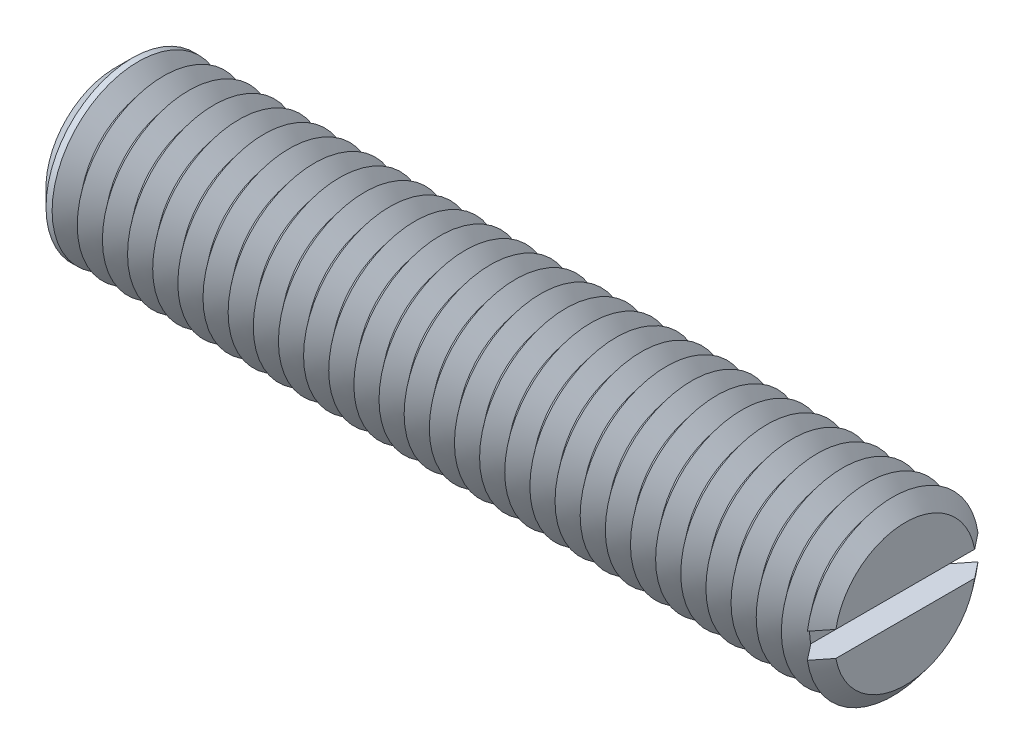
ISO-10303-21;
HEADER;
FILE_DESCRIPTION(('STEP AP214'),'2;1');
FILE_NAME('part.step','',(''),(''),'','','');
FILE_SCHEMA(('AUTOMOTIVE_DESIGN { 1 0 10303 214 1 1 1 1 }'));
ENDSEC;
DATA;
#1=APPLICATION_CONTEXT('core data for automotive mechanical design processes');
#2=APPLICATION_PROTOCOL_DEFINITION('international standard','automotive_design',2000,#1);
#3=PRODUCT_CONTEXT('',#1,'mechanical');
#4=PRODUCT('Part','Part','',(#3));
#5=PRODUCT_RELATED_PRODUCT_CATEGORY('part','',(#4));
#6=PRODUCT_DEFINITION_FORMATION('','',#4);
#7=PRODUCT_DEFINITION_CONTEXT('part definition',#1,'design');
#8=PRODUCT_DEFINITION('design','',#6,#7);
#9=PRODUCT_DEFINITION_SHAPE('','',#8);
#10=(LENGTH_UNIT() NAMED_UNIT(*) SI_UNIT(.MILLI.,.METRE.));
#11=(NAMED_UNIT(*) PLANE_ANGLE_UNIT() SI_UNIT($,.RADIAN.));
#12=(NAMED_UNIT(*) SI_UNIT($,.STERADIAN.) SOLID_ANGLE_UNIT());
#13=UNCERTAINTY_MEASURE_WITH_UNIT(LENGTH_MEASURE(1.E-05),#10,'distance_accuracy_value','');
#14=(GEOMETRIC_REPRESENTATION_CONTEXT(3) GLOBAL_UNCERTAINTY_ASSIGNED_CONTEXT((#13)) GLOBAL_UNIT_ASSIGNED_CONTEXT((#10,
#11,#12)) REPRESENTATION_CONTEXT('',''));
#15=CARTESIAN_POINT('',(0.,0.,0.));
#16=DIRECTION('',(0.,0.,1.));
#17=DIRECTION('',(1.,0.,0.));
#18=AXIS2_PLACEMENT_3D('',#15,#16,#17);
#19=CARTESIAN_POINT('',(26.625,0.,0.));
#20=DIRECTION('',(1.,0.,0.));
#21=DIRECTION('',(0.,0.,-1.));
#22=AXIS2_PLACEMENT_3D('',#19,#20,#21);
#23=CONICAL_SURFACE('',#22,6.,0.895664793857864);
#24=CARTESIAN_POINT('',(26.625,0.,0.));
#25=DIRECTION('',(-1.,0.,0.));
#26=DIRECTION('',(0.,0.,1.));
#27=AXIS2_PLACEMENT_3D('',#24,#25,#26);
#28=CIRCLE('',#27,6.);
#29=CARTESIAN_POINT('',(26.625,-0.875,-5.93585503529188));
#30=VERTEX_POINT('',#29);
#31=CARTESIAN_POINT('',(26.625,-0.875,5.93585503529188));
#32=VERTEX_POINT('',#31);
#33=EDGE_CURVE('E117',#30,#32,#28,.T.);
#34=ORIENTED_EDGE('',*,*,#33,.T.);
#35=CARTESIAN_POINT('',(32.315666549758,-0.875,-13.0784023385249));
#36=CARTESIAN_POINT('',(31.9425848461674,-0.875,-12.6113718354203));
#37=CARTESIAN_POINT('',(31.5695485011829,-0.875,-12.1443050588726));
#38=CARTESIAN_POINT('',(30.8235952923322,-0.875,-11.2100035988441));
#39=CARTESIAN_POINT('',(30.4506784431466,-0.875,-10.7427689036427));
#40=CARTESIAN_POINT('',(29.7043910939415,-0.875,-9.80728158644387));
#41=CARTESIAN_POINT('',(29.3310209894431,-0.875,-9.33902864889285));
#42=CARTESIAN_POINT('',(28.584654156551,-0.875,-8.40229688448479));
#43=CARTESIAN_POINT('',(28.2116573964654,-0.875,-7.93381808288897));
#44=CARTESIAN_POINT('',(27.6431910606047,-0.875,-7.21894008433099));
#45=CARTESIAN_POINT('',(27.4475150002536,-0.875,-6.97270509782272));
#46=CARTESIAN_POINT('',(27.0563780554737,-0.875,-6.48006014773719));
#47=CARTESIAN_POINT('',(26.860917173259,-0.875,-6.23365018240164));
#48=CARTESIAN_POINT('',(26.4702437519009,-0.875,-5.74051596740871));
#49=CARTESIAN_POINT('',(26.2750313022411,-0.875,-5.49379164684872));
#50=CARTESIAN_POINT('',(25.8850627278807,-0.875,-4.99999724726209));
#51=CARTESIAN_POINT('',(25.6903065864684,-0.875,-4.75292718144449));
#52=CARTESIAN_POINT('',(25.3017454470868,-0.875,-4.25854698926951));
#53=CARTESIAN_POINT('',(25.1079395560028,-0.875,-4.01123756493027));
#54=CARTESIAN_POINT('',(24.7214614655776,-0.875,-3.51567639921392));
#55=CARTESIAN_POINT('',(24.5287894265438,-0.875,-3.26742453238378));
#56=CARTESIAN_POINT('',(24.2415141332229,-0.875,-2.89382702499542));
#57=CARTESIAN_POINT('',(24.1460716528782,-0.875,-2.76912721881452));
#58=CARTESIAN_POINT('',(23.9560120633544,-0.875,-2.51908954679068));
#59=CARTESIAN_POINT('',(23.8613949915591,-0.875,-2.39375165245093));
#60=CARTESIAN_POINT('',(23.6734585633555,-0.875,-2.14215479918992));
#61=CARTESIAN_POINT('',(23.5801388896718,-0.875,-2.01589607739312));
#62=CARTESIAN_POINT('',(23.3955738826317,-0.875,-1.7618740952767));
#63=CARTESIAN_POINT('',(23.3043283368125,-0.875,-1.63411099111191));
#64=CARTESIAN_POINT('',(23.1947335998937,-0.875,-1.47575777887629));
#65=CARTESIAN_POINT('',(23.1745750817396,-0.875,-1.44642115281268));
#66=CARTESIAN_POINT('',(23.1344943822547,-0.875,-1.38758643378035));
#67=CARTESIAN_POINT('',(23.1145722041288,-0.875,-1.35808833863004));
#68=CARTESIAN_POINT('',(23.0552118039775,-0.875,-1.26931303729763));
#69=CARTESIAN_POINT('',(23.0161833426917,-0.875,-1.20976002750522));
#70=CARTESIAN_POINT('',(22.939598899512,-0.875,-1.08955604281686));
#71=CARTESIAN_POINT('',(22.9020457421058,-0.875,-1.02890325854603));
#72=CARTESIAN_POINT('',(22.8292052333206,-0.875,-0.9062523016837));
#73=CARTESIAN_POINT('',(22.7939174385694,-0.875,-0.844254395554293));
#74=CARTESIAN_POINT('',(22.7387563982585,-0.875,-0.740802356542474));
#75=CARTESIAN_POINT('',(22.717869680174,-0.875,-0.69989655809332));
#76=CARTESIAN_POINT('',(22.6780353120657,-0.875,-0.617162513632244));
#77=CARTESIAN_POINT('',(22.6590880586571,-0.875,-0.575334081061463));
#78=CARTESIAN_POINT('',(22.606232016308,-0.875,-0.448426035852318));
#79=CARTESIAN_POINT('',(22.5761075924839,-0.875,-0.361569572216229));
#80=CARTESIAN_POINT('',(22.5472166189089,-0.875,-0.240214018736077));
#81=CARTESIAN_POINT('',(22.5406925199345,-0.875,-0.207555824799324));
#82=CARTESIAN_POINT('',(22.5303887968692,-0.875,-0.14181650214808));
#83=CARTESIAN_POINT('',(22.5266076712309,-0.875,-0.108735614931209));
#84=CARTESIAN_POINT('',(22.5220436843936,-0.875,-0.0424543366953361));
#85=CARTESIAN_POINT('',(22.5212526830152,-0.875,-0.00925451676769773));
#86=CARTESIAN_POINT('',(22.522702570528,-0.875,0.0570804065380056));
#87=CARTESIAN_POINT('',(22.5249438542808,-0.875,0.0902155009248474));
#88=CARTESIAN_POINT('',(22.5331880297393,-0.875,0.164063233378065));
#89=CARTESIAN_POINT('',(22.5399634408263,-0.875,0.20468951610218));
#90=CARTESIAN_POINT('',(22.5573167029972,-0.875,0.28512674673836));
#91=CARTESIAN_POINT('',(22.5678973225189,-0.875,0.324937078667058));
#92=CARTESIAN_POINT('',(22.5921930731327,-0.875,0.403898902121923));
#93=CARTESIAN_POINT('',(22.6059311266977,-0.875,0.443043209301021));
#94=CARTESIAN_POINT('',(22.6357974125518,-0.875,0.520385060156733));
#95=CARTESIAN_POINT('',(22.651925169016,-0.875,0.558582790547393));
#96=CARTESIAN_POINT('',(22.7021457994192,-0.875,0.669991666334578));
#97=CARTESIAN_POINT('',(22.7387706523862,-0.875,0.742052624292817));
#98=CARTESIAN_POINT('',(22.816117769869,-0.875,0.883956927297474));
#99=CARTESIAN_POINT('',(22.8568440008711,-0.875,0.953798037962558));
#100=CARTESIAN_POINT('',(22.9409804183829,-0.875,1.09208391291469));
#101=CARTESIAN_POINT('',(22.9843973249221,-0.875,1.16052456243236));
#102=CARTESIAN_POINT('',(23.0729384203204,-0.875,1.29629435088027));
#103=CARTESIAN_POINT('',(23.118062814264,-0.875,1.36362335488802));
#104=CARTESIAN_POINT('',(23.2096565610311,-0.875,1.49772496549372));
#105=CARTESIAN_POINT('',(23.2561302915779,-0.875,1.56449457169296));
#106=CARTESIAN_POINT('',(23.3499281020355,-0.875,1.69744165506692));
#107=CARTESIAN_POINT('',(23.3972522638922,-0.875,1.76361907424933));
#108=CARTESIAN_POINT('',(23.4924358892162,-0.875,1.89539956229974));
#109=CARTESIAN_POINT('',(23.5402941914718,-0.875,1.96100347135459));
#110=CARTESIAN_POINT('',(23.6364816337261,-0.875,2.09186112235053));
#111=CARTESIAN_POINT('',(23.6848107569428,-0.875,2.15711487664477));
#112=CARTESIAN_POINT('',(23.8290907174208,-0.875,2.35079303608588));
#113=CARTESIAN_POINT('',(23.925565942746,-0.875,2.47882657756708));
#114=CARTESIAN_POINT('',(24.1194152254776,-0.875,2.73421191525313));
#115=CARTESIAN_POINT('',(24.216789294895,-0.875,2.86156370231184));
#116=CARTESIAN_POINT('',(24.50981832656,-0.875,3.24294102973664));
#117=CARTESIAN_POINT('',(24.7063709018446,-0.875,3.49627631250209));
#118=CARTESIAN_POINT('',(25.1008478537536,-0.875,4.00219025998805));
#119=CARTESIAN_POINT('',(25.2987731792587,-0.875,4.25476818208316));
#120=CARTESIAN_POINT('',(25.6953507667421,-0.875,4.75934213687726));
#121=CARTESIAN_POINT('',(25.894003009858,-0.875,5.01133818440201));
#122=CARTESIAN_POINT('',(26.2908446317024,-0.875,5.51379367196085));
#123=CARTESIAN_POINT('',(26.4890318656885,-0.875,5.76425480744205));
#124=CARTESIAN_POINT('',(26.8857195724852,-0.875,6.2649316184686));
#125=CARTESIAN_POINT('',(27.0842200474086,-0.875,6.51514729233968));
#126=CARTESIAN_POINT('',(27.6799499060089,-0.875,7.26541710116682));
#127=CARTESIAN_POINT('',(28.0775028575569,-0.875,7.76521426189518));
#128=CARTESIAN_POINT('',(28.794311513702,-0.875,8.66550309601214));
#129=CARTESIAN_POINT('',(29.1134832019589,-0.875,9.0660617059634));
#130=CARTESIAN_POINT('',(29.7520581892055,-0.875,9.8670423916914));
#131=CARTESIAN_POINT('',(30.0714615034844,-0.875,10.2674644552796));
#132=CARTESIAN_POINT('',(30.7116162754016,-0.875,11.0697025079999));
#133=CARTESIAN_POINT('',(31.0323682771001,-0.875,11.4715180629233));
#134=CARTESIAN_POINT('',(31.6739570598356,-0.875,12.2750327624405));
#135=CARTESIAN_POINT('',(31.9947938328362,-0.875,12.6767319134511));
#136=CARTESIAN_POINT('',(32.315666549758,-0.875,13.0784023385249));
#137=B_SPLINE_CURVE_WITH_KNOTS('',3,(#35,#36,#37,#38,#39,#40,#41,#42,#43,#44,#45,#46,#47,#48,
#49,#50,#51,#52,#53,#54,#55,#56,#57,#58,#59,#60,#61,#62,#63,#64,#65,#66,#67,#68,#69,#70,#71,#72,
#73,#74,#75,#76,#77,#78,#79,#80,#81,#82,#83,#84,#85,#86,#87,#88,#89,#90,#91,#92,#93,#94,#95,#96,
#97,#98,#99,#100,#101,#102,#103,#104,#105,#106,#107,#108,#109,#110,#111,#112,#113,#114,#115,
#116,#117,#118,#119,#120,#121,#122,#123,#124,#125,#126,#127,#128,#129,#130,#131,#132,#133,#134,
#135,#136),.UNSPECIFIED.,.F.,.F.,(4,2,2,2,2,2,2,2,2,2,2,2,2,2,2,2,2,2,2,2,2,2,2,2,2,2,2,2,2,2,2,
2,2,2,2,2,2,2,2,2,2,2,2,2,2,2,2,2,2,2,4),(0.,1.79325603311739,3.58668207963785,5.38334403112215,
7.17983772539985,8.12338791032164,9.06694771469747,10.0107838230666,10.9545848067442,
11.8971886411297,12.8399226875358,13.3110192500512,13.7821370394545,14.2531375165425,
14.72408952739,14.8308734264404,14.9376587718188,15.1512485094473,15.3652290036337,
15.5791674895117,15.7169026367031,15.8546658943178,16.1289739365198,16.2287885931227,
16.3285485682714,16.4280367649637,16.5275379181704,16.6508760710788,16.7743041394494,
16.8986582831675,17.0229876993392,17.2652294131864,17.5077076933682,17.7508180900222,
17.9939577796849,18.2380016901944,18.4820692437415,18.7256822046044,18.9692865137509,
19.4502162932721,19.9311525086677,20.8930708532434,21.855738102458,22.8183805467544,
23.7765455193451,24.7347169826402,26.6505999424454,28.1871088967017,29.7237307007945,
31.2661438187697,32.8084427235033),.UNSPECIFIED.);
#138=CARTESIAN_POINT('',(25.75,-0.875,4.82848363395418));
#139=VERTEX_POINT('',#138);
#140=EDGE_CURVE('E109',#139,#32,#137,.T.);
#141=ORIENTED_EDGE('',*,*,#140,.F.);
#142=CARTESIAN_POINT('',(25.75,0.,0.));
#143=DIRECTION('',(-1.,0.,0.));
#144=DIRECTION('',(0.,0.,1.));
#145=AXIS2_PLACEMENT_3D('',#142,#143,#144);
#146=CIRCLE('',#145,4.90712535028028);
#147=CARTESIAN_POINT('',(25.75,-0.875,-4.82848363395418));
#148=VERTEX_POINT('',#147);
#149=EDGE_CURVE('E464',#148,#139,#146,.T.);
#150=ORIENTED_EDGE('',*,*,#149,.F.);
#151=EDGE_CURVE('E58',#30,#148,#137,.T.);
#152=ORIENTED_EDGE('',*,*,#151,.F.);
#153=EDGE_LOOP('',(#34,#141,#150,#152));
#154=FACE_BOUND('',#153,.T.);
#155=ADVANCED_FACE('F37',(#154),#23,.T.);
#156=CARTESIAN_POINT('',(26.625,0.875,5.93585503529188));
#157=VERTEX_POINT('',#156);
#158=CARTESIAN_POINT('',(26.625,0.875,-5.93585503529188));
#159=VERTEX_POINT('',#158);
#160=EDGE_CURVE('E100',#157,#159,#28,.T.);
#161=ORIENTED_EDGE('',*,*,#160,.T.);
#162=CARTESIAN_POINT('',(32.315666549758,0.875,13.0784023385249));
#163=CARTESIAN_POINT('',(31.9425848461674,0.875,12.6113718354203));
#164=CARTESIAN_POINT('',(31.5695485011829,0.875,12.1443050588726));
#165=CARTESIAN_POINT('',(30.8235952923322,0.875,11.2100035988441));
#166=CARTESIAN_POINT('',(30.4506784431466,0.875,10.7427689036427));
#167=CARTESIAN_POINT('',(29.7043910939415,0.875,9.80728158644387));
#168=CARTESIAN_POINT('',(29.3310209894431,0.875,9.33902864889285));
#169=CARTESIAN_POINT('',(28.584654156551,0.875,8.40229688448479));
#170=CARTESIAN_POINT('',(28.2116573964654,0.875,7.93381808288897));
#171=CARTESIAN_POINT('',(27.6431910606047,0.875,7.21894008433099));
#172=CARTESIAN_POINT('',(27.4475150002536,0.875,6.97270509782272));
#173=CARTESIAN_POINT('',(27.0563780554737,0.875,6.48006014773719));
#174=CARTESIAN_POINT('',(26.860917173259,0.875,6.23365018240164));
#175=CARTESIAN_POINT('',(26.4702437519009,0.875,5.74051596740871));
#176=CARTESIAN_POINT('',(26.2750313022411,0.875,5.49379164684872));
#177=CARTESIAN_POINT('',(25.8850627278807,0.875,4.99999724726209));
#178=CARTESIAN_POINT('',(25.6903065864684,0.875,4.75292718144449));
#179=CARTESIAN_POINT('',(25.3017454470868,0.875,4.25854698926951));
#180=CARTESIAN_POINT('',(25.1079395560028,0.875,4.01123756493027));
#181=CARTESIAN_POINT('',(24.7214614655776,0.875,3.51567639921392));
#182=CARTESIAN_POINT('',(24.5287894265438,0.875,3.26742453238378));
#183=CARTESIAN_POINT('',(24.2415141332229,0.875,2.89382702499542));
#184=CARTESIAN_POINT('',(24.1460716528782,0.875,2.76912721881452));
#185=CARTESIAN_POINT('',(23.9560120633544,0.875,2.51908954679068));
#186=CARTESIAN_POINT('',(23.8613949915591,0.875,2.39375165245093));
#187=CARTESIAN_POINT('',(23.6734585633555,0.875,2.14215479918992));
#188=CARTESIAN_POINT('',(23.5801388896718,0.875,2.01589607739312));
#189=CARTESIAN_POINT('',(23.3955738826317,0.875,1.7618740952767));
#190=CARTESIAN_POINT('',(23.3043283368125,0.875,1.63411099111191));
#191=CARTESIAN_POINT('',(23.1947335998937,0.875,1.47575777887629));
#192=CARTESIAN_POINT('',(23.1745750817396,0.875,1.44642115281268));
#193=CARTESIAN_POINT('',(23.1344943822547,0.875,1.38758643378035));
#194=CARTESIAN_POINT('',(23.1145722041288,0.875,1.35808833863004));
#195=CARTESIAN_POINT('',(23.0552118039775,0.875,1.26931303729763));
#196=CARTESIAN_POINT('',(23.0161833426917,0.875,1.20976002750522));
#197=CARTESIAN_POINT('',(22.939598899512,0.875,1.08955604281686));
#198=CARTESIAN_POINT('',(22.9020457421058,0.875,1.02890325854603));
#199=CARTESIAN_POINT('',(22.8292052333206,0.875,0.9062523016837));
#200=CARTESIAN_POINT('',(22.7939174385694,0.875,0.844254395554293));
#201=CARTESIAN_POINT('',(22.7387563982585,0.875,0.740802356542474));
#202=CARTESIAN_POINT('',(22.717869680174,0.875,0.69989655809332));
#203=CARTESIAN_POINT('',(22.6780353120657,0.875,0.617162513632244));
#204=CARTESIAN_POINT('',(22.6590880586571,0.875,0.575334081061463));
#205=CARTESIAN_POINT('',(22.606232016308,0.875,0.448426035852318));
#206=CARTESIAN_POINT('',(22.5761075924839,0.875,0.361569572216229));
#207=CARTESIAN_POINT('',(22.5472166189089,0.875,0.240214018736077));
#208=CARTESIAN_POINT('',(22.5406925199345,0.875,0.207555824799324));
#209=CARTESIAN_POINT('',(22.5303887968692,0.875,0.14181650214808));
#210=CARTESIAN_POINT('',(22.5266076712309,0.875,0.108735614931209));
#211=CARTESIAN_POINT('',(22.5220436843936,0.875,0.0424543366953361));
#212=CARTESIAN_POINT('',(22.5212526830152,0.875,0.00925451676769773));
#213=CARTESIAN_POINT('',(22.522702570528,0.875,-0.0570804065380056));
#214=CARTESIAN_POINT('',(22.5249438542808,0.875,-0.0902155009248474));
#215=CARTESIAN_POINT('',(22.5331880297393,0.875,-0.164063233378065));
#216=CARTESIAN_POINT('',(22.5399634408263,0.875,-0.20468951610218));
#217=CARTESIAN_POINT('',(22.5573167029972,0.875,-0.28512674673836));
#218=CARTESIAN_POINT('',(22.5678973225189,0.875,-0.324937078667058));
#219=CARTESIAN_POINT('',(22.5921930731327,0.875,-0.403898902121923));
#220=CARTESIAN_POINT('',(22.6059311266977,0.875,-0.443043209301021));
#221=CARTESIAN_POINT('',(22.6357974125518,0.875,-0.520385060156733));
#222=CARTESIAN_POINT('',(22.651925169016,0.875,-0.558582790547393));
#223=CARTESIAN_POINT('',(22.7021457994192,0.875,-0.669991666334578));
#224=CARTESIAN_POINT('',(22.7387706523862,0.875,-0.742052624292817));
#225=CARTESIAN_POINT('',(22.816117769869,0.875,-0.883956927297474));
#226=CARTESIAN_POINT('',(22.8568440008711,0.875,-0.953798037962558));
#227=CARTESIAN_POINT('',(22.9409804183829,0.875,-1.09208391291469));
#228=CARTESIAN_POINT('',(22.9843973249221,0.875,-1.16052456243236));
#229=CARTESIAN_POINT('',(23.0729384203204,0.875,-1.29629435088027));
#230=CARTESIAN_POINT('',(23.118062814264,0.875,-1.36362335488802));
#231=CARTESIAN_POINT('',(23.2096565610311,0.875,-1.49772496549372));
#232=CARTESIAN_POINT('',(23.2561302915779,0.875,-1.56449457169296));
#233=CARTESIAN_POINT('',(23.3499281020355,0.875,-1.69744165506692));
#234=CARTESIAN_POINT('',(23.3972522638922,0.875,-1.76361907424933));
#235=CARTESIAN_POINT('',(23.4924358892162,0.875,-1.89539956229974));
#236=CARTESIAN_POINT('',(23.5402941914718,0.875,-1.96100347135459));
#237=CARTESIAN_POINT('',(23.6364816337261,0.875,-2.09186112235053));
#238=CARTESIAN_POINT('',(23.6848107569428,0.875,-2.15711487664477));
#239=CARTESIAN_POINT('',(23.8290907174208,0.875,-2.35079303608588));
#240=CARTESIAN_POINT('',(23.925565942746,0.875,-2.47882657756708));
#241=CARTESIAN_POINT('',(24.1194152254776,0.875,-2.73421191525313));
#242=CARTESIAN_POINT('',(24.216789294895,0.875,-2.86156370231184));
#243=CARTESIAN_POINT('',(24.50981832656,0.875,-3.24294102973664));
#244=CARTESIAN_POINT('',(24.7063709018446,0.875,-3.49627631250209));
#245=CARTESIAN_POINT('',(25.1008478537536,0.875,-4.00219025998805));
#246=CARTESIAN_POINT('',(25.2987731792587,0.875,-4.25476818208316));
#247=CARTESIAN_POINT('',(25.6953507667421,0.875,-4.75934213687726));
#248=CARTESIAN_POINT('',(25.894003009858,0.875,-5.01133818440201));
#249=CARTESIAN_POINT('',(26.2908446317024,0.875,-5.51379367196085));
#250=CARTESIAN_POINT('',(26.4890318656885,0.875,-5.76425480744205));
#251=CARTESIAN_POINT('',(26.8857195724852,0.875,-6.2649316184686));
#252=CARTESIAN_POINT('',(27.0842200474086,0.875,-6.51514729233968));
#253=CARTESIAN_POINT('',(27.6799499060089,0.875,-7.26541710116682));
#254=CARTESIAN_POINT('',(28.0775028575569,0.875,-7.76521426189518));
#255=CARTESIAN_POINT('',(28.794311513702,0.875,-8.66550309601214));
#256=CARTESIAN_POINT('',(29.1134832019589,0.875,-9.0660617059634));
#257=CARTESIAN_POINT('',(29.7520581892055,0.875,-9.8670423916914));
#258=CARTESIAN_POINT('',(30.0714615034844,0.875,-10.2674644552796));
#259=CARTESIAN_POINT('',(30.7116162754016,0.875,-11.0697025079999));
#260=CARTESIAN_POINT('',(31.0323682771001,0.875,-11.4715180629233));
#261=CARTESIAN_POINT('',(31.6739570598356,0.875,-12.2750327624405));
#262=CARTESIAN_POINT('',(31.9947938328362,0.875,-12.6767319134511));
#263=CARTESIAN_POINT('',(32.315666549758,0.875,-13.0784023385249));
#264=B_SPLINE_CURVE_WITH_KNOTS('',3,(#162,#163,#164,#165,#166,#167,#168,#169,#170,#171,#172,
#173,#174,#175,#176,#177,#178,#179,#180,#181,#182,#183,#184,#185,#186,#187,#188,#189,#190,#191,
#192,#193,#194,#195,#196,#197,#198,#199,#200,#201,#202,#203,#204,#205,#206,#207,#208,#209,#210,
#211,#212,#213,#214,#215,#216,#217,#218,#219,#220,#221,#222,#223,#224,#225,#226,#227,#228,#229,
#230,#231,#232,#233,#234,#235,#236,#237,#238,#239,#240,#241,#242,#243,#244,#245,#246,#247,#248,
#249,#250,#251,#252,#253,#254,#255,#256,#257,#258,#259,#260,#261,#262,#263),.UNSPECIFIED.,.F.,
.F.,(4,2,2,2,2,2,2,2,2,2,2,2,2,2,2,2,2,2,2,2,2,2,2,2,2,2,2,2,2,2,2,2,2,2,2,2,2,2,2,2,2,2,2,2,2,
2,2,2,2,2,4),(0.,1.79325603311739,3.58668207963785,5.38334403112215,7.17983772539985,
8.12338791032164,9.06694771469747,10.0107838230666,10.9545848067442,11.8971886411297,
12.8399226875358,13.3110192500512,13.7821370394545,14.2531375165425,14.72408952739,
14.8308734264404,14.9376587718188,15.1512485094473,15.3652290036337,15.5791674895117,
15.7169026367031,15.8546658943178,16.1289739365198,16.2287885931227,16.3285485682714,
16.4280367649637,16.5275379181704,16.6508760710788,16.7743041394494,16.8986582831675,
17.0229876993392,17.2652294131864,17.5077076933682,17.7508180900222,17.9939577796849,
18.2380016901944,18.4820692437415,18.7256822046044,18.9692865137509,19.4502162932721,
19.9311525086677,20.8930708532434,21.855738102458,22.8183805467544,23.7765455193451,
24.7347169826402,26.6505999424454,28.1871088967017,29.7237307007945,31.2661438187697,
32.8084427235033),.UNSPECIFIED.);
#265=CARTESIAN_POINT('',(25.75,0.875,-4.82848363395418));
#266=VERTEX_POINT('',#265);
#267=EDGE_CURVE('E110',#266,#159,#264,.T.);
#268=ORIENTED_EDGE('',*,*,#267,.F.);
#269=CARTESIAN_POINT('',(25.75,0.875,4.82848363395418));
#270=VERTEX_POINT('',#269);
#271=EDGE_CURVE('E103',#270,#266,#146,.T.);
#272=ORIENTED_EDGE('',*,*,#271,.F.);
#273=EDGE_CURVE('E97',#157,#270,#264,.T.);
#274=ORIENTED_EDGE('',*,*,#273,.F.);
#275=EDGE_LOOP('',(#161,#268,#272,#274));
#276=FACE_BOUND('',#275,.T.);
#277=ADVANCED_FACE('F99',(#276),#23,.T.);
#278=CARTESIAN_POINT('',(25.75,0.,0.));
#279=DIRECTION('',(-1.,0.,0.));
#280=DIRECTION('',(0.,0.,1.));
#281=AXIS2_PLACEMENT_3D('',#278,#279,#280);
#282=CONICAL_SURFACE('',#281,4.90712535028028,0.895664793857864);
#283=CARTESIAN_POINT('',(24.875,0.,0.));
#284=DIRECTION('',(-1.,0.,0.));
#285=DIRECTION('',(0.,0.,1.));
#286=AXIS2_PLACEMENT_3D('',#283,#284,#285);
#287=CIRCLE('',#286,6.);
#288=CARTESIAN_POINT('',(24.875,0.,6.));
#289=VERTEX_POINT('',#288);
#290=EDGE_CURVE('E450',#289,#289,#287,.T.);
#291=ORIENTED_EDGE('',*,*,#290,.F.);
#292=EDGE_LOOP('',(#291));
#293=FACE_BOUND('',#292,.T.);
#294=ORIENTED_EDGE('',*,*,#271,.T.);
#295=EDGE_CURVE('E458',#266,#148,#146,.T.);
#296=ORIENTED_EDGE('',*,*,#295,.T.);
#297=ORIENTED_EDGE('',*,*,#149,.T.);
#298=EDGE_CURVE('E457',#139,#270,#146,.T.);
#299=ORIENTED_EDGE('',*,*,#298,.T.);
#300=EDGE_LOOP('',(#294,#296,#297,#299));
#301=FACE_BOUND('',#300,.T.);
#302=ADVANCED_FACE('F166',(#293,#301),#282,.T.);
#303=CARTESIAN_POINT('',(27.5,0.,0.));
#304=DIRECTION('',(1.,0.,0.));
#305=DIRECTION('',(0.,0.,-1.));
#306=AXIS2_PLACEMENT_3D('',#303,#304,#305);
#307=PLANE('',#306);
#308=CARTESIAN_POINT('',(27.5,0.,0.));
#309=DIRECTION('',(-1.,0.,0.));
#310=DIRECTION('',(0.,0.,1.));
#311=AXIS2_PLACEMENT_3D('',#308,#309,#310);
#312=CIRCLE('',#311,4.90712535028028);
#313=CARTESIAN_POINT('',(27.5,0.875,4.82848363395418));
#314=VERTEX_POINT('',#313);
#315=CARTESIAN_POINT('',(27.5,0.875,-4.82848363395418));
#316=VERTEX_POINT('',#315);
#317=EDGE_CURVE('E158',#314,#316,#312,.T.);
#318=ORIENTED_EDGE('',*,*,#317,.F.);
#319=DIRECTION('',(0.,0.,1.));
#320=VECTOR('',#319,1.);
#321=CARTESIAN_POINT('',(27.5,0.875,0.));
#322=LINE('',#321,#320);
#323=EDGE_CURVE('E122',#316,#314,#322,.T.);
#324=ORIENTED_EDGE('',*,*,#323,.F.);
#325=EDGE_LOOP('',(#318,#324));
#326=FACE_BOUND('',#325,.T.);
#327=ADVANCED_FACE('F170',(#326),#307,.T.);
#328=CARTESIAN_POINT('',(27.5,-0.875,-4.82848363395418));
#329=VERTEX_POINT('',#328);
#330=CARTESIAN_POINT('',(27.5,-0.875,4.82848363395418));
#331=VERTEX_POINT('',#330);
#332=EDGE_CURVE('E66',#329,#331,#312,.T.);
#333=ORIENTED_EDGE('',*,*,#332,.F.);
#334=DIRECTION('',(0.,0.,-1.));
#335=VECTOR('',#334,1.);
#336=CARTESIAN_POINT('',(27.5,-0.875,0.));
#337=LINE('',#336,#335);
#338=EDGE_CURVE('E134',#331,#329,#337,.T.);
#339=ORIENTED_EDGE('',*,*,#338,.F.);
#340=EDGE_LOOP('',(#333,#339));
#341=FACE_BOUND('',#340,.T.);
#342=ADVANCED_FACE('F199',(#341),#307,.T.);
#343=CARTESIAN_POINT('',(27.5,0.,0.));
#344=DIRECTION('',(-1.,0.,0.));
#345=DIRECTION('',(0.,0.,1.));
#346=AXIS2_PLACEMENT_3D('',#343,#344,#345);
#347=CONICAL_SURFACE('',#346,4.90712535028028,0.895664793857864);
#348=ORIENTED_EDGE('',*,*,#160,.F.);
#349=CARTESIAN_POINT('',(20.934333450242,0.875,-13.0784023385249));
#350=CARTESIAN_POINT('',(21.3074151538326,0.875,-12.6113718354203));
#351=CARTESIAN_POINT('',(21.6804514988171,0.875,-12.1443050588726));
#352=CARTESIAN_POINT('',(22.4264047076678,0.875,-11.2100035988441));
#353=CARTESIAN_POINT('',(22.7993215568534,0.875,-10.7427689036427));
#354=CARTESIAN_POINT('',(23.5456089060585,0.875,-9.80728158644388));
#355=CARTESIAN_POINT('',(23.9189790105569,0.875,-9.33902864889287));
#356=CARTESIAN_POINT('',(24.6653458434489,0.875,-8.40229688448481));
#357=CARTESIAN_POINT('',(25.0383426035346,0.875,-7.93381808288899));
#358=CARTESIAN_POINT('',(25.6068089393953,0.875,-7.21894008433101));
#359=CARTESIAN_POINT('',(25.8024849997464,0.875,-6.97270509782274));
#360=CARTESIAN_POINT('',(26.1936219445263,0.875,-6.48006014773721));
#361=CARTESIAN_POINT('',(26.389082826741,0.875,-6.23365018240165));
#362=CARTESIAN_POINT('',(26.7797562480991,0.875,-5.74051596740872));
#363=CARTESIAN_POINT('',(26.9749686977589,0.875,-5.49379164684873));
#364=CARTESIAN_POINT('',(27.3649372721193,0.875,-4.9999972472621));
#365=CARTESIAN_POINT('',(27.5596934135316,0.875,-4.7529271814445));
#366=CARTESIAN_POINT('',(27.9482545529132,0.875,-4.25854698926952));
#367=CARTESIAN_POINT('',(28.1420604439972,0.875,-4.01123756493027));
#368=CARTESIAN_POINT('',(28.5285385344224,0.875,-3.51567639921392));
#369=CARTESIAN_POINT('',(28.7212105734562,0.875,-3.26742453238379));
#370=CARTESIAN_POINT('',(29.0084858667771,0.875,-2.89382702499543));
#371=CARTESIAN_POINT('',(29.1039283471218,0.875,-2.76912721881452));
#372=CARTESIAN_POINT('',(29.2939879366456,0.875,-2.51908954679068));
#373=CARTESIAN_POINT('',(29.3886050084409,0.875,-2.39375165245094));
#374=CARTESIAN_POINT('',(29.5765414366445,0.875,-2.14215479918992));
#375=CARTESIAN_POINT('',(29.6698611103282,0.875,-2.01589607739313));
#376=CARTESIAN_POINT('',(29.8544261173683,0.875,-1.76187409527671));
#377=CARTESIAN_POINT('',(29.9456716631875,0.875,-1.63411099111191));
#378=CARTESIAN_POINT('',(30.0552664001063,0.875,-1.47575777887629));
#379=CARTESIAN_POINT('',(30.0754249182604,0.875,-1.44642115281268));
#380=CARTESIAN_POINT('',(30.1155056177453,0.875,-1.38758643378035));
#381=CARTESIAN_POINT('',(30.1354277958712,0.875,-1.35808833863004));
#382=CARTESIAN_POINT('',(30.1947881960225,0.875,-1.26931303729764));
#383=CARTESIAN_POINT('',(30.2338166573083,0.875,-1.20976002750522));
#384=CARTESIAN_POINT('',(30.310401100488,0.875,-1.08955604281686));
#385=CARTESIAN_POINT('',(30.3479542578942,0.875,-1.02890325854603));
#386=CARTESIAN_POINT('',(30.4207947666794,0.875,-0.906252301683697));
#387=CARTESIAN_POINT('',(30.4560825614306,0.875,-0.84425439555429));
#388=CARTESIAN_POINT('',(30.5112436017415,0.875,-0.74080235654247));
#389=CARTESIAN_POINT('',(30.532130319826,0.875,-0.699896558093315));
#390=CARTESIAN_POINT('',(30.5719646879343,0.875,-0.617162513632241));
#391=CARTESIAN_POINT('',(30.5909119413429,0.875,-0.575334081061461));
#392=CARTESIAN_POINT('',(30.643767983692,0.875,-0.448426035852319));
#393=CARTESIAN_POINT('',(30.6738924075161,0.875,-0.361569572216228));
#394=CARTESIAN_POINT('',(30.7027833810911,0.875,-0.240214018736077));
#395=CARTESIAN_POINT('',(30.7093074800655,0.875,-0.207555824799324));
#396=CARTESIAN_POINT('',(30.7196112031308,0.875,-0.141816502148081));
#397=CARTESIAN_POINT('',(30.7233923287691,0.875,-0.108735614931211));
#398=CARTESIAN_POINT('',(30.7279563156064,0.875,-0.04245433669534));
#399=CARTESIAN_POINT('',(30.7287473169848,0.875,-0.0092545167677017));
#400=CARTESIAN_POINT('',(30.727297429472,0.875,0.0570804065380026));
#401=CARTESIAN_POINT('',(30.7250561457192,0.875,0.0902155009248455));
#402=CARTESIAN_POINT('',(30.7168119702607,0.875,0.164063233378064));
#403=CARTESIAN_POINT('',(30.7100365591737,0.875,0.204689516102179));
#404=CARTESIAN_POINT('',(30.6926832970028,0.875,0.28512674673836));
#405=CARTESIAN_POINT('',(30.6821026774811,0.875,0.324937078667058));
#406=CARTESIAN_POINT('',(30.6578069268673,0.875,0.403898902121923));
#407=CARTESIAN_POINT('',(30.6440688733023,0.875,0.443043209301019));
#408=CARTESIAN_POINT('',(30.6142025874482,0.875,0.520385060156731));
#409=CARTESIAN_POINT('',(30.598074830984,0.875,0.558582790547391));
#410=CARTESIAN_POINT('',(30.5478542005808,0.875,0.669991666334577));
#411=CARTESIAN_POINT('',(30.5112293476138,0.875,0.742052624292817));
#412=CARTESIAN_POINT('',(30.433882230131,0.875,0.883956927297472));
#413=CARTESIAN_POINT('',(30.3931559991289,0.875,0.953798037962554));
#414=CARTESIAN_POINT('',(30.3090195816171,0.875,1.09208391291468));
#415=CARTESIAN_POINT('',(30.2656026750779,0.875,1.16052456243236));
#416=CARTESIAN_POINT('',(30.1770615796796,0.875,1.29629435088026));
#417=CARTESIAN_POINT('',(30.131937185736,0.875,1.36362335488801));
#418=CARTESIAN_POINT('',(30.0403434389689,0.875,1.49772496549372));
#419=CARTESIAN_POINT('',(29.9938697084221,0.875,1.56449457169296));
#420=CARTESIAN_POINT('',(29.9000718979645,0.875,1.69744165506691));
#421=CARTESIAN_POINT('',(29.8527477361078,0.875,1.76361907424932));
#422=CARTESIAN_POINT('',(29.7575641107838,0.875,1.89539956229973));
#423=CARTESIAN_POINT('',(29.7097058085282,0.875,1.96100347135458));
#424=CARTESIAN_POINT('',(29.613518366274,0.875,2.09186112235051));
#425=CARTESIAN_POINT('',(29.5651892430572,0.875,2.15711487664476));
#426=CARTESIAN_POINT('',(29.4209092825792,0.875,2.35079303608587));
#427=CARTESIAN_POINT('',(29.324434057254,0.875,2.47882657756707));
#428=CARTESIAN_POINT('',(29.1305847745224,0.875,2.73421191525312));
#429=CARTESIAN_POINT('',(29.033210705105,0.875,2.86156370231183));
#430=CARTESIAN_POINT('',(28.7401816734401,0.875,3.24294102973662));
#431=CARTESIAN_POINT('',(28.5436290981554,0.875,3.49627631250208));
#432=CARTESIAN_POINT('',(28.1491521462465,0.875,4.00219025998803));
#433=CARTESIAN_POINT('',(27.9512268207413,0.875,4.25476818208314));
#434=CARTESIAN_POINT('',(27.5546492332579,0.875,4.75934213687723));
#435=CARTESIAN_POINT('',(27.355996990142,0.875,5.01133818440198));
#436=CARTESIAN_POINT('',(26.9591553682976,0.875,5.51379367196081));
#437=CARTESIAN_POINT('',(26.7609681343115,0.875,5.76425480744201));
#438=CARTESIAN_POINT('',(26.3642804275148,0.875,6.26493161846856));
#439=CARTESIAN_POINT('',(26.1657799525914,0.875,6.51514729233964));
#440=CARTESIAN_POINT('',(25.5700500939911,0.875,7.26541710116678));
#441=CARTESIAN_POINT('',(25.1724971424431,0.875,7.76521426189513));
#442=CARTESIAN_POINT('',(24.4556884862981,0.875,8.66550309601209));
#443=CARTESIAN_POINT('',(24.1365167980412,0.875,9.06606170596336));
#444=CARTESIAN_POINT('',(23.4979418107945,0.875,9.86704239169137));
#445=CARTESIAN_POINT('',(23.1785384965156,0.875,10.2674644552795));
#446=CARTESIAN_POINT('',(22.5383837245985,0.875,11.0697025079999));
#447=CARTESIAN_POINT('',(22.2176317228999,0.875,11.4715180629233));
#448=CARTESIAN_POINT('',(21.5760429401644,0.875,12.2750327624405));
#449=CARTESIAN_POINT('',(21.2552061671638,0.875,12.6767319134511));
#450=CARTESIAN_POINT('',(20.934333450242,0.875,13.0784023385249));
#451=B_SPLINE_CURVE_WITH_KNOTS('',3,(#349,#350,#351,#352,#353,#354,#355,#356,#357,#358,#359,
#360,#361,#362,#363,#364,#365,#366,#367,#368,#369,#370,#371,#372,#373,#374,#375,#376,#377,#378,
#379,#380,#381,#382,#383,#384,#385,#386,#387,#388,#389,#390,#391,#392,#393,#394,#395,#396,#397,
#398,#399,#400,#401,#402,#403,#404,#405,#406,#407,#408,#409,#410,#411,#412,#413,#414,#415,#416,
#417,#418,#419,#420,#421,#422,#423,#424,#425,#426,#427,#428,#429,#430,#431,#432,#433,#434,#435,
#436,#437,#438,#439,#440,#441,#442,#443,#444,#445,#446,#447,#448,#449,#450),.UNSPECIFIED.,.F.,
.F.,(4,2,2,2,2,2,2,2,2,2,2,2,2,2,2,2,2,2,2,2,2,2,2,2,2,2,2,2,2,2,2,2,2,2,2,2,2,2,2,2,2,2,2,2,2,
2,2,2,2,2,4),(0.,1.79325603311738,3.58668207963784,5.38334403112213,7.17983772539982,
8.12338791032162,9.06694771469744,10.0107838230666,10.9545848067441,11.8971886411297,
12.8399226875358,13.3110192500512,13.7821370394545,14.2531375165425,14.72408952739,
14.8308734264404,14.9376587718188,15.1512485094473,15.3652290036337,15.5791674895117,
15.7169026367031,15.8546658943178,16.1289739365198,16.2287885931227,16.3285485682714,
16.4280367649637,16.5275379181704,16.6508760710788,16.7743041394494,16.8986582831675,
17.0229876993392,17.2652294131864,17.5077076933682,17.7508180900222,17.9939577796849,
18.2380016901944,18.4820692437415,18.7256822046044,18.9692865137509,19.4502162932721,
19.9311525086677,20.8930708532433,21.855738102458,22.8183805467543,23.776545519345,
24.7347169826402,26.6505999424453,28.1871088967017,29.7237307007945,31.2661438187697,
32.8084427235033),.UNSPECIFIED.);
#452=EDGE_CURVE('E41',#314,#157,#451,.T.);
#453=ORIENTED_EDGE('',*,*,#452,.F.);
#454=ORIENTED_EDGE('',*,*,#317,.T.);
#455=EDGE_CURVE('E11',#159,#316,#451,.T.);
#456=ORIENTED_EDGE('',*,*,#455,.F.);
#457=EDGE_LOOP('',(#348,#453,#454,#456));
#458=FACE_BOUND('',#457,.T.);
#459=ADVANCED_FACE('F114',(#458),#347,.T.);
#460=CARTESIAN_POINT('',(27.5,0.875,-9.));
#461=DIRECTION('',(0.,1.,0.));
#462=DIRECTION('',(0.,0.,1.));
#463=AXIS2_PLACEMENT_3D('',#460,#461,#462);
#464=PLANE('',#463);
#465=ORIENTED_EDGE('',*,*,#452,.T.);
#466=ORIENTED_EDGE('',*,*,#273,.T.);
#467=DIRECTION('',(0.,0.,1.));
#468=VECTOR('',#467,1.);
#469=CARTESIAN_POINT('',(25.75,0.875,-9.));
#470=LINE('',#469,#468);
#471=EDGE_CURVE('E143',#266,#270,#470,.T.);
#472=ORIENTED_EDGE('',*,*,#471,.F.);
#473=ORIENTED_EDGE('',*,*,#267,.T.);
#474=ORIENTED_EDGE('',*,*,#455,.T.);
#475=ORIENTED_EDGE('',*,*,#323,.T.);
#476=EDGE_LOOP('',(#465,#466,#472,#473,#474,#475));
#477=FACE_BOUND('',#476,.T.);
#478=ADVANCED_FACE('F120',(#477),#464,.F.);
#479=ORIENTED_EDGE('',*,*,#33,.F.);
#480=CARTESIAN_POINT('',(20.934333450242,-0.875,13.0784023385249));
#481=CARTESIAN_POINT('',(21.3074151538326,-0.875,12.6113718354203));
#482=CARTESIAN_POINT('',(21.6804514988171,-0.875,12.1443050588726));
#483=CARTESIAN_POINT('',(22.4264047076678,-0.875,11.2100035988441));
#484=CARTESIAN_POINT('',(22.7993215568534,-0.875,10.7427689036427));
#485=CARTESIAN_POINT('',(23.5456089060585,-0.875,9.80728158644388));
#486=CARTESIAN_POINT('',(23.9189790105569,-0.875,9.33902864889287));
#487=CARTESIAN_POINT('',(24.6653458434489,-0.875,8.40229688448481));
#488=CARTESIAN_POINT('',(25.0383426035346,-0.875,7.93381808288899));
#489=CARTESIAN_POINT('',(25.6068089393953,-0.875,7.21894008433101));
#490=CARTESIAN_POINT('',(25.8024849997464,-0.875,6.97270509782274));
#491=CARTESIAN_POINT('',(26.1936219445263,-0.875,6.48006014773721));
#492=CARTESIAN_POINT('',(26.389082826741,-0.875,6.23365018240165));
#493=CARTESIAN_POINT('',(26.7797562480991,-0.875,5.74051596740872));
#494=CARTESIAN_POINT('',(26.9749686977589,-0.875,5.49379164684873));
#495=CARTESIAN_POINT('',(27.3649372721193,-0.875,4.9999972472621));
#496=CARTESIAN_POINT('',(27.5596934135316,-0.875,4.7529271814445));
#497=CARTESIAN_POINT('',(27.9482545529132,-0.875,4.25854698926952));
#498=CARTESIAN_POINT('',(28.1420604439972,-0.875,4.01123756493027));
#499=CARTESIAN_POINT('',(28.5285385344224,-0.875,3.51567639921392));
#500=CARTESIAN_POINT('',(28.7212105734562,-0.875,3.26742453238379));
#501=CARTESIAN_POINT('',(29.0084858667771,-0.875,2.89382702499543));
#502=CARTESIAN_POINT('',(29.1039283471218,-0.875,2.76912721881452));
#503=CARTESIAN_POINT('',(29.2939879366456,-0.875,2.51908954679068));
#504=CARTESIAN_POINT('',(29.3886050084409,-0.875,2.39375165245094));
#505=CARTESIAN_POINT('',(29.5765414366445,-0.875,2.14215479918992));
#506=CARTESIAN_POINT('',(29.6698611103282,-0.875,2.01589607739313));
#507=CARTESIAN_POINT('',(29.8544261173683,-0.875,1.76187409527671));
#508=CARTESIAN_POINT('',(29.9456716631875,-0.875,1.63411099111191));
#509=CARTESIAN_POINT('',(30.0552664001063,-0.875,1.47575777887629));
#510=CARTESIAN_POINT('',(30.0754249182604,-0.875,1.44642115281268));
#511=CARTESIAN_POINT('',(30.1155056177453,-0.875,1.38758643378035));
#512=CARTESIAN_POINT('',(30.1354277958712,-0.875,1.35808833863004));
#513=CARTESIAN_POINT('',(30.1947881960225,-0.875,1.26931303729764));
#514=CARTESIAN_POINT('',(30.2338166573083,-0.875,1.20976002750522));
#515=CARTESIAN_POINT('',(30.310401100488,-0.875,1.08955604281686));
#516=CARTESIAN_POINT('',(30.3479542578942,-0.875,1.02890325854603));
#517=CARTESIAN_POINT('',(30.4207947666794,-0.875,0.906252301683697));
#518=CARTESIAN_POINT('',(30.4560825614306,-0.875,0.84425439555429));
#519=CARTESIAN_POINT('',(30.5112436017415,-0.875,0.74080235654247));
#520=CARTESIAN_POINT('',(30.532130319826,-0.875,0.699896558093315));
#521=CARTESIAN_POINT('',(30.5719646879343,-0.875,0.617162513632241));
#522=CARTESIAN_POINT('',(30.5909119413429,-0.875,0.575334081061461));
#523=CARTESIAN_POINT('',(30.643767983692,-0.875,0.448426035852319));
#524=CARTESIAN_POINT('',(30.6738924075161,-0.875,0.361569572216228));
#525=CARTESIAN_POINT('',(30.7027833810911,-0.875,0.240214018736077));
#526=CARTESIAN_POINT('',(30.7093074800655,-0.875,0.207555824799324));
#527=CARTESIAN_POINT('',(30.7196112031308,-0.875,0.141816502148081));
#528=CARTESIAN_POINT('',(30.7233923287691,-0.875,0.108735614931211));
#529=CARTESIAN_POINT('',(30.7279563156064,-0.875,0.04245433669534));
#530=CARTESIAN_POINT('',(30.7287473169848,-0.875,0.0092545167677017));
#531=CARTESIAN_POINT('',(30.727297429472,-0.875,-0.0570804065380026));
#532=CARTESIAN_POINT('',(30.7250561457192,-0.875,-0.0902155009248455));
#533=CARTESIAN_POINT('',(30.7168119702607,-0.875,-0.164063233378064));
#534=CARTESIAN_POINT('',(30.7100365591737,-0.875,-0.204689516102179));
#535=CARTESIAN_POINT('',(30.6926832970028,-0.875,-0.28512674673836));
#536=CARTESIAN_POINT('',(30.6821026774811,-0.875,-0.324937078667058));
#537=CARTESIAN_POINT('',(30.6578069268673,-0.875,-0.403898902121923));
#538=CARTESIAN_POINT('',(30.6440688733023,-0.875,-0.443043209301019));
#539=CARTESIAN_POINT('',(30.6142025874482,-0.875,-0.520385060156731));
#540=CARTESIAN_POINT('',(30.598074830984,-0.875,-0.558582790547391));
#541=CARTESIAN_POINT('',(30.5478542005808,-0.875,-0.669991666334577));
#542=CARTESIAN_POINT('',(30.5112293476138,-0.875,-0.742052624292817));
#543=CARTESIAN_POINT('',(30.433882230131,-0.875,-0.883956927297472));
#544=CARTESIAN_POINT('',(30.3931559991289,-0.875,-0.953798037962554));
#545=CARTESIAN_POINT('',(30.3090195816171,-0.875,-1.09208391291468));
#546=CARTESIAN_POINT('',(30.2656026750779,-0.875,-1.16052456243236));
#547=CARTESIAN_POINT('',(30.1770615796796,-0.875,-1.29629435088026));
#548=CARTESIAN_POINT('',(30.131937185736,-0.875,-1.36362335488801));
#549=CARTESIAN_POINT('',(30.0403434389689,-0.875,-1.49772496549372));
#550=CARTESIAN_POINT('',(29.9938697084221,-0.875,-1.56449457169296));
#551=CARTESIAN_POINT('',(29.9000718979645,-0.875,-1.69744165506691));
#552=CARTESIAN_POINT('',(29.8527477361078,-0.875,-1.76361907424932));
#553=CARTESIAN_POINT('',(29.7575641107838,-0.875,-1.89539956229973));
#554=CARTESIAN_POINT('',(29.7097058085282,-0.875,-1.96100347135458));
#555=CARTESIAN_POINT('',(29.613518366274,-0.875,-2.09186112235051));
#556=CARTESIAN_POINT('',(29.5651892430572,-0.875,-2.15711487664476));
#557=CARTESIAN_POINT('',(29.4209092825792,-0.875,-2.35079303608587));
#558=CARTESIAN_POINT('',(29.324434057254,-0.875,-2.47882657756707));
#559=CARTESIAN_POINT('',(29.1305847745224,-0.875,-2.73421191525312));
#560=CARTESIAN_POINT('',(29.033210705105,-0.875,-2.86156370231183));
#561=CARTESIAN_POINT('',(28.7401816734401,-0.875,-3.24294102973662));
#562=CARTESIAN_POINT('',(28.5436290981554,-0.875,-3.49627631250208));
#563=CARTESIAN_POINT('',(28.1491521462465,-0.875,-4.00219025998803));
#564=CARTESIAN_POINT('',(27.9512268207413,-0.875,-4.25476818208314));
#565=CARTESIAN_POINT('',(27.5546492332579,-0.875,-4.75934213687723));
#566=CARTESIAN_POINT('',(27.355996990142,-0.875,-5.01133818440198));
#567=CARTESIAN_POINT('',(26.9591553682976,-0.875,-5.51379367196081));
#568=CARTESIAN_POINT('',(26.7609681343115,-0.875,-5.76425480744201));
#569=CARTESIAN_POINT('',(26.3642804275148,-0.875,-6.26493161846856));
#570=CARTESIAN_POINT('',(26.1657799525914,-0.875,-6.51514729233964));
#571=CARTESIAN_POINT('',(25.5700500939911,-0.875,-7.26541710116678));
#572=CARTESIAN_POINT('',(25.1724971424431,-0.875,-7.76521426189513));
#573=CARTESIAN_POINT('',(24.4556884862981,-0.875,-8.66550309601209));
#574=CARTESIAN_POINT('',(24.1365167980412,-0.875,-9.06606170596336));
#575=CARTESIAN_POINT('',(23.4979418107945,-0.875,-9.86704239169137));
#576=CARTESIAN_POINT('',(23.1785384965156,-0.875,-10.2674644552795));
#577=CARTESIAN_POINT('',(22.5383837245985,-0.875,-11.0697025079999));
#578=CARTESIAN_POINT('',(22.2176317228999,-0.875,-11.4715180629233));
#579=CARTESIAN_POINT('',(21.5760429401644,-0.875,-12.2750327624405));
#580=CARTESIAN_POINT('',(21.2552061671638,-0.875,-12.6767319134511));
#581=CARTESIAN_POINT('',(20.934333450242,-0.875,-13.0784023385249));
#582=B_SPLINE_CURVE_WITH_KNOTS('',3,(#480,#481,#482,#483,#484,#485,#486,#487,#488,#489,#490,
#491,#492,#493,#494,#495,#496,#497,#498,#499,#500,#501,#502,#503,#504,#505,#506,#507,#508,#509,
#510,#511,#512,#513,#514,#515,#516,#517,#518,#519,#520,#521,#522,#523,#524,#525,#526,#527,#528,
#529,#530,#531,#532,#533,#534,#535,#536,#537,#538,#539,#540,#541,#542,#543,#544,#545,#546,#547,
#548,#549,#550,#551,#552,#553,#554,#555,#556,#557,#558,#559,#560,#561,#562,#563,#564,#565,#566,
#567,#568,#569,#570,#571,#572,#573,#574,#575,#576,#577,#578,#579,#580,#581),.UNSPECIFIED.,.F.,
.F.,(4,2,2,2,2,2,2,2,2,2,2,2,2,2,2,2,2,2,2,2,2,2,2,2,2,2,2,2,2,2,2,2,2,2,2,2,2,2,2,2,2,2,2,2,2,
2,2,2,2,2,4),(0.,1.79325603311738,3.58668207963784,5.38334403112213,7.17983772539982,
8.12338791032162,9.06694771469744,10.0107838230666,10.9545848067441,11.8971886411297,
12.8399226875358,13.3110192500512,13.7821370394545,14.2531375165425,14.72408952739,
14.8308734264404,14.9376587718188,15.1512485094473,15.3652290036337,15.5791674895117,
15.7169026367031,15.8546658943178,16.1289739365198,16.2287885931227,16.3285485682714,
16.4280367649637,16.5275379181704,16.6508760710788,16.7743041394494,16.8986582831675,
17.0229876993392,17.2652294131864,17.5077076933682,17.7508180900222,17.9939577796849,
18.2380016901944,18.4820692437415,18.7256822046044,18.9692865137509,19.4502162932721,
19.9311525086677,20.8930708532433,21.855738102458,22.8183805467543,23.776545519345,
24.7347169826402,26.6505999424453,28.1871088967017,29.7237307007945,31.2661438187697,
32.8084427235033),.UNSPECIFIED.);
#583=EDGE_CURVE('E150',#329,#30,#582,.T.);
#584=ORIENTED_EDGE('',*,*,#583,.F.);
#585=ORIENTED_EDGE('',*,*,#332,.T.);
#586=EDGE_CURVE('E146',#32,#331,#582,.T.);
#587=ORIENTED_EDGE('',*,*,#586,.F.);
#588=EDGE_LOOP('',(#479,#584,#585,#587));
#589=FACE_BOUND('',#588,.T.);
#590=ADVANCED_FACE('F162',(#589),#347,.T.);
#591=CARTESIAN_POINT('',(27.5,-0.875,-9.));
#592=DIRECTION('',(0.,-1.,0.));
#593=DIRECTION('',(0.,0.,-1.));
#594=AXIS2_PLACEMENT_3D('',#591,#592,#593);
#595=PLANE('',#594);
#596=ORIENTED_EDGE('',*,*,#583,.T.);
#597=ORIENTED_EDGE('',*,*,#151,.T.);
#598=DIRECTION('',(0.,0.,1.));
#599=VECTOR('',#598,1.);
#600=CARTESIAN_POINT('',(25.75,-0.875,-9.));
#601=LINE('',#600,#599);
#602=EDGE_CURVE('E142',#148,#139,#601,.T.);
#603=ORIENTED_EDGE('',*,*,#602,.T.);
#604=ORIENTED_EDGE('',*,*,#140,.T.);
#605=ORIENTED_EDGE('',*,*,#586,.T.);
#606=ORIENTED_EDGE('',*,*,#338,.T.);
#607=EDGE_LOOP('',(#596,#597,#603,#604,#605,#606));
#608=FACE_BOUND('',#607,.T.);
#609=ADVANCED_FACE('F159',(#608),#595,.F.);
#610=CARTESIAN_POINT('',(25.75,0.875,-9.));
#611=DIRECTION('',(-1.,0.,0.));
#612=DIRECTION('',(0.,0.,1.));
#613=AXIS2_PLACEMENT_3D('',#610,#611,#612);
#614=PLANE('',#613);
#615=ORIENTED_EDGE('',*,*,#602,.F.);
#616=ORIENTED_EDGE('',*,*,#295,.F.);
#617=ORIENTED_EDGE('',*,*,#471,.T.);
#618=ORIENTED_EDGE('',*,*,#298,.F.);
#619=EDGE_LOOP('',(#615,#616,#617,#618));
#620=FACE_BOUND('',#619,.T.);
#621=ADVANCED_FACE('F468',(#620),#614,.F.);
#622=CARTESIAN_POINT('',(24.,0.,0.));
#623=DIRECTION('',(-1.,0.,0.));
#624=DIRECTION('',(0.,0.,1.));
#625=AXIS2_PLACEMENT_3D('',#622,#623,#624);
#626=CONICAL_SURFACE('',#625,4.90712535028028,0.895664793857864);
#627=CARTESIAN_POINT('',(23.125,0.,0.));
#628=DIRECTION('',(-1.,0.,0.));
#629=DIRECTION('',(0.,0.,1.));
#630=AXIS2_PLACEMENT_3D('',#627,#628,#629);
#631=CIRCLE('',#630,6.);
#632=CARTESIAN_POINT('',(23.125,0.,6.));
#633=VERTEX_POINT('',#632);
#634=EDGE_CURVE('E443',#633,#633,#631,.T.);
#635=ORIENTED_EDGE('',*,*,#634,.F.);
#636=EDGE_LOOP('',(#635));
#637=FACE_BOUND('',#636,.T.);
#638=CARTESIAN_POINT('',(24.,0.,0.));
#639=DIRECTION('',(-1.,0.,0.));
#640=DIRECTION('',(0.,0.,1.));
#641=AXIS2_PLACEMENT_3D('',#638,#639,#640);
#642=CIRCLE('',#641,4.90712535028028);
#643=CARTESIAN_POINT('',(24.,0.,4.90712535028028));
#644=VERTEX_POINT('',#643);
#645=EDGE_CURVE('E454',#644,#644,#642,.T.);
#646=ORIENTED_EDGE('',*,*,#645,.T.);
#647=EDGE_LOOP('',(#646));
#648=FACE_BOUND('',#647,.T.);
#649=ADVANCED_FACE('F175',(#637,#648),#626,.T.);
#650=CARTESIAN_POINT('',(24.875,0.,0.));
#651=DIRECTION('',(1.,0.,0.));
#652=DIRECTION('',(0.,0.,-1.));
#653=AXIS2_PLACEMENT_3D('',#650,#651,#652);
#654=CONICAL_SURFACE('',#653,6.,0.895664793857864);
#655=ORIENTED_EDGE('',*,*,#645,.F.);
#656=EDGE_LOOP('',(#655));
#657=FACE_BOUND('',#656,.T.);
#658=ORIENTED_EDGE('',*,*,#290,.T.);
#659=EDGE_LOOP('',(#658));
#660=FACE_BOUND('',#659,.T.);
#661=ADVANCED_FACE('F474',(#657,#660),#654,.T.);
#662=CARTESIAN_POINT('',(22.25,0.,0.));
#663=DIRECTION('',(-1.,0.,0.));
#664=DIRECTION('',(0.,0.,1.));
#665=AXIS2_PLACEMENT_3D('',#662,#663,#664);
#666=CONICAL_SURFACE('',#665,4.90712535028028,0.895664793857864);
#667=CARTESIAN_POINT('',(21.375,0.,0.));
#668=DIRECTION('',(-1.,0.,0.));
#669=DIRECTION('',(0.,0.,1.));
#670=AXIS2_PLACEMENT_3D('',#667,#668,#669);
#671=CIRCLE('',#670,6.);
#672=CARTESIAN_POINT('',(21.375,0.,6.));
#673=VERTEX_POINT('',#672);
#674=EDGE_CURVE('E435',#673,#673,#671,.T.);
#675=ORIENTED_EDGE('',*,*,#674,.F.);
#676=EDGE_LOOP('',(#675));
#677=FACE_BOUND('',#676,.T.);
#678=CARTESIAN_POINT('',(22.25,0.,0.));
#679=DIRECTION('',(-1.,0.,0.));
#680=DIRECTION('',(0.,0.,1.));
#681=AXIS2_PLACEMENT_3D('',#678,#679,#680);
#682=CIRCLE('',#681,4.90712535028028);
#683=CARTESIAN_POINT('',(22.25,0.,4.90712535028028));
#684=VERTEX_POINT('',#683);
#685=EDGE_CURVE('E447',#684,#684,#682,.T.);
#686=ORIENTED_EDGE('',*,*,#685,.T.);
#687=EDGE_LOOP('',(#686));
#688=FACE_BOUND('',#687,.T.);
#689=ADVANCED_FACE('F538',(#677,#688),#666,.T.);
#690=CARTESIAN_POINT('',(23.125,0.,0.));
#691=DIRECTION('',(1.,0.,0.));
#692=DIRECTION('',(0.,0.,-1.));
#693=AXIS2_PLACEMENT_3D('',#690,#691,#692);
#694=CONICAL_SURFACE('',#693,6.,0.895664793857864);
#695=ORIENTED_EDGE('',*,*,#685,.F.);
#696=EDGE_LOOP('',(#695));
#697=FACE_BOUND('',#696,.T.);
#698=ORIENTED_EDGE('',*,*,#634,.T.);
#699=EDGE_LOOP('',(#698));
#700=FACE_BOUND('',#699,.T.);
#701=ADVANCED_FACE('F547',(#697,#700),#694,.T.);
#702=CARTESIAN_POINT('',(20.5,0.,0.));
#703=DIRECTION('',(-1.,0.,0.));
#704=DIRECTION('',(0.,0.,1.));
#705=AXIS2_PLACEMENT_3D('',#702,#703,#704);
#706=CONICAL_SURFACE('',#705,4.90712535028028,0.895664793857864);
#707=CARTESIAN_POINT('',(19.625,0.,0.));
#708=DIRECTION('',(-1.,0.,0.));
#709=DIRECTION('',(0.,0.,1.));
#710=AXIS2_PLACEMENT_3D('',#707,#708,#709);
#711=CIRCLE('',#710,6.);
#712=CARTESIAN_POINT('',(19.625,0.,6.));
#713=VERTEX_POINT('',#712);
#714=EDGE_CURVE('E428',#713,#713,#711,.T.);
#715=ORIENTED_EDGE('',*,*,#714,.F.);
#716=EDGE_LOOP('',(#715));
#717=FACE_BOUND('',#716,.T.);
#718=CARTESIAN_POINT('',(20.5,0.,0.));
#719=DIRECTION('',(-1.,0.,0.));
#720=DIRECTION('',(0.,0.,1.));
#721=AXIS2_PLACEMENT_3D('',#718,#719,#720);
#722=CIRCLE('',#721,4.90712535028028);
#723=CARTESIAN_POINT('',(20.5,0.,4.90712535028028));
#724=VERTEX_POINT('',#723);
#725=EDGE_CURVE('E439',#724,#724,#722,.T.);
#726=ORIENTED_EDGE('',*,*,#725,.T.);
#727=EDGE_LOOP('',(#726));
#728=FACE_BOUND('',#727,.T.);
#729=ADVANCED_FACE('F557',(#717,#728),#706,.T.);
#730=CARTESIAN_POINT('',(21.375,0.,0.));
#731=DIRECTION('',(1.,0.,0.));
#732=DIRECTION('',(0.,0.,-1.));
#733=AXIS2_PLACEMENT_3D('',#730,#731,#732);
#734=CONICAL_SURFACE('',#733,6.,0.895664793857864);
#735=ORIENTED_EDGE('',*,*,#725,.F.);
#736=EDGE_LOOP('',(#735));
#737=FACE_BOUND('',#736,.T.);
#738=ORIENTED_EDGE('',*,*,#674,.T.);
#739=EDGE_LOOP('',(#738));
#740=FACE_BOUND('',#739,.T.);
#741=ADVANCED_FACE('F567',(#737,#740),#734,.T.);
#742=CARTESIAN_POINT('',(18.75,0.,0.));
#743=DIRECTION('',(-1.,0.,0.));
#744=DIRECTION('',(0.,0.,1.));
#745=AXIS2_PLACEMENT_3D('',#742,#743,#744);
#746=CONICAL_SURFACE('',#745,4.90712535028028,0.895664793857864);
#747=CARTESIAN_POINT('',(17.875,0.,0.));
#748=DIRECTION('',(-1.,0.,0.));
#749=DIRECTION('',(0.,0.,1.));
#750=AXIS2_PLACEMENT_3D('',#747,#748,#749);
#751=CIRCLE('',#750,6.);
#752=CARTESIAN_POINT('',(17.875,0.,6.));
#753=VERTEX_POINT('',#752);
#754=EDGE_CURVE('E420',#753,#753,#751,.T.);
#755=ORIENTED_EDGE('',*,*,#754,.F.);
#756=EDGE_LOOP('',(#755));
#757=FACE_BOUND('',#756,.T.);
#758=CARTESIAN_POINT('',(18.75,0.,0.));
#759=DIRECTION('',(-1.,0.,0.));
#760=DIRECTION('',(0.,0.,1.));
#761=AXIS2_PLACEMENT_3D('',#758,#759,#760);
#762=CIRCLE('',#761,4.90712535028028);
#763=CARTESIAN_POINT('',(18.75,0.,4.90712535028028));
#764=VERTEX_POINT('',#763);
#765=EDGE_CURVE('E431',#764,#764,#762,.T.);
#766=ORIENTED_EDGE('',*,*,#765,.T.);
#767=EDGE_LOOP('',(#766));
#768=FACE_BOUND('',#767,.T.);
#769=ADVANCED_FACE('F577',(#757,#768),#746,.T.);
#770=CARTESIAN_POINT('',(19.625,0.,0.));
#771=DIRECTION('',(1.,0.,0.));
#772=DIRECTION('',(0.,0.,-1.));
#773=AXIS2_PLACEMENT_3D('',#770,#771,#772);
#774=CONICAL_SURFACE('',#773,6.,0.895664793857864);
#775=ORIENTED_EDGE('',*,*,#765,.F.);
#776=EDGE_LOOP('',(#775));
#777=FACE_BOUND('',#776,.T.);
#778=ORIENTED_EDGE('',*,*,#714,.T.);
#779=EDGE_LOOP('',(#778));
#780=FACE_BOUND('',#779,.T.);
#781=ADVANCED_FACE('F587',(#777,#780),#774,.T.);
#782=CARTESIAN_POINT('',(17.,0.,0.));
#783=DIRECTION('',(-1.,0.,0.));
#784=DIRECTION('',(0.,0.,1.));
#785=AXIS2_PLACEMENT_3D('',#782,#783,#784);
#786=CONICAL_SURFACE('',#785,4.90712535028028,0.895664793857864);
#787=CARTESIAN_POINT('',(16.125,0.,0.));
#788=DIRECTION('',(-1.,0.,0.));
#789=DIRECTION('',(0.,0.,1.));
#790=AXIS2_PLACEMENT_3D('',#787,#788,#789);
#791=CIRCLE('',#790,6.);
#792=CARTESIAN_POINT('',(16.125,0.,6.));
#793=VERTEX_POINT('',#792);
#794=EDGE_CURVE('E412',#793,#793,#791,.T.);
#795=ORIENTED_EDGE('',*,*,#794,.F.);
#796=EDGE_LOOP('',(#795));
#797=FACE_BOUND('',#796,.T.);
#798=CARTESIAN_POINT('',(17.,0.,0.));
#799=DIRECTION('',(-1.,0.,0.));
#800=DIRECTION('',(0.,0.,1.));
#801=AXIS2_PLACEMENT_3D('',#798,#799,#800);
#802=CIRCLE('',#801,4.90712535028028);
#803=CARTESIAN_POINT('',(17.,0.,4.90712535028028));
#804=VERTEX_POINT('',#803);
#805=EDGE_CURVE('E424',#804,#804,#802,.T.);
#806=ORIENTED_EDGE('',*,*,#805,.T.);
#807=EDGE_LOOP('',(#806));
#808=FACE_BOUND('',#807,.T.);
#809=ADVANCED_FACE('F597',(#797,#808),#786,.T.);
#810=CARTESIAN_POINT('',(17.875,0.,0.));
#811=DIRECTION('',(1.,0.,0.));
#812=DIRECTION('',(0.,0.,-1.));
#813=AXIS2_PLACEMENT_3D('',#810,#811,#812);
#814=CONICAL_SURFACE('',#813,6.,0.895664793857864);
#815=ORIENTED_EDGE('',*,*,#805,.F.);
#816=EDGE_LOOP('',(#815));
#817=FACE_BOUND('',#816,.T.);
#818=ORIENTED_EDGE('',*,*,#754,.T.);
#819=EDGE_LOOP('',(#818));
#820=FACE_BOUND('',#819,.T.);
#821=ADVANCED_FACE('F607',(#817,#820),#814,.T.);
#822=CARTESIAN_POINT('',(15.25,0.,0.));
#823=DIRECTION('',(-1.,0.,0.));
#824=DIRECTION('',(0.,0.,1.));
#825=AXIS2_PLACEMENT_3D('',#822,#823,#824);
#826=CONICAL_SURFACE('',#825,4.90712535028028,0.895664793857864);
#827=CARTESIAN_POINT('',(14.375,0.,0.));
#828=DIRECTION('',(-1.,0.,0.));
#829=DIRECTION('',(0.,0.,1.));
#830=AXIS2_PLACEMENT_3D('',#827,#828,#829);
#831=CIRCLE('',#830,6.);
#832=CARTESIAN_POINT('',(14.375,0.,6.));
#833=VERTEX_POINT('',#832);
#834=EDGE_CURVE('E404',#833,#833,#831,.T.);
#835=ORIENTED_EDGE('',*,*,#834,.F.);
#836=EDGE_LOOP('',(#835));
#837=FACE_BOUND('',#836,.T.);
#838=CARTESIAN_POINT('',(15.25,0.,0.));
#839=DIRECTION('',(-1.,0.,0.));
#840=DIRECTION('',(0.,0.,1.));
#841=AXIS2_PLACEMENT_3D('',#838,#839,#840);
#842=CIRCLE('',#841,4.90712535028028);
#843=CARTESIAN_POINT('',(15.25,0.,4.90712535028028));
#844=VERTEX_POINT('',#843);
#845=EDGE_CURVE('E416',#844,#844,#842,.T.);
#846=ORIENTED_EDGE('',*,*,#845,.T.);
#847=EDGE_LOOP('',(#846));
#848=FACE_BOUND('',#847,.T.);
#849=ADVANCED_FACE('F617',(#837,#848),#826,.T.);
#850=CARTESIAN_POINT('',(16.125,0.,0.));
#851=DIRECTION('',(1.,0.,0.));
#852=DIRECTION('',(0.,0.,-1.));
#853=AXIS2_PLACEMENT_3D('',#850,#851,#852);
#854=CONICAL_SURFACE('',#853,6.,0.895664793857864);
#855=ORIENTED_EDGE('',*,*,#845,.F.);
#856=EDGE_LOOP('',(#855));
#857=FACE_BOUND('',#856,.T.);
#858=ORIENTED_EDGE('',*,*,#794,.T.);
#859=EDGE_LOOP('',(#858));
#860=FACE_BOUND('',#859,.T.);
#861=ADVANCED_FACE('F627',(#857,#860),#854,.T.);
#862=CARTESIAN_POINT('',(13.5,0.,0.));
#863=DIRECTION('',(-1.,0.,0.));
#864=DIRECTION('',(0.,0.,1.));
#865=AXIS2_PLACEMENT_3D('',#862,#863,#864);
#866=CONICAL_SURFACE('',#865,4.90712535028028,0.895664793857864);
#867=CARTESIAN_POINT('',(12.625,0.,0.));
#868=DIRECTION('',(-1.,0.,0.));
#869=DIRECTION('',(0.,0.,1.));
#870=AXIS2_PLACEMENT_3D('',#867,#868,#869);
#871=CIRCLE('',#870,6.);
#872=CARTESIAN_POINT('',(12.625,0.,6.));
#873=VERTEX_POINT('',#872);
#874=EDGE_CURVE('E396',#873,#873,#871,.T.);
#875=ORIENTED_EDGE('',*,*,#874,.F.);
#876=EDGE_LOOP('',(#875));
#877=FACE_BOUND('',#876,.T.);
#878=CARTESIAN_POINT('',(13.5,0.,0.));
#879=DIRECTION('',(-1.,0.,0.));
#880=DIRECTION('',(0.,0.,1.));
#881=AXIS2_PLACEMENT_3D('',#878,#879,#880);
#882=CIRCLE('',#881,4.90712535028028);
#883=CARTESIAN_POINT('',(13.5,0.,4.90712535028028));
#884=VERTEX_POINT('',#883);
#885=EDGE_CURVE('E408',#884,#884,#882,.T.);
#886=ORIENTED_EDGE('',*,*,#885,.T.);
#887=EDGE_LOOP('',(#886));
#888=FACE_BOUND('',#887,.T.);
#889=ADVANCED_FACE('F637',(#877,#888),#866,.T.);
#890=CARTESIAN_POINT('',(14.375,0.,0.));
#891=DIRECTION('',(1.,0.,0.));
#892=DIRECTION('',(0.,0.,-1.));
#893=AXIS2_PLACEMENT_3D('',#890,#891,#892);
#894=CONICAL_SURFACE('',#893,6.,0.895664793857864);
#895=ORIENTED_EDGE('',*,*,#885,.F.);
#896=EDGE_LOOP('',(#895));
#897=FACE_BOUND('',#896,.T.);
#898=ORIENTED_EDGE('',*,*,#834,.T.);
#899=EDGE_LOOP('',(#898));
#900=FACE_BOUND('',#899,.T.);
#901=ADVANCED_FACE('F647',(#897,#900),#894,.T.);
#902=CARTESIAN_POINT('',(11.75,0.,0.));
#903=DIRECTION('',(-1.,0.,0.));
#904=DIRECTION('',(0.,0.,1.));
#905=AXIS2_PLACEMENT_3D('',#902,#903,#904);
#906=CONICAL_SURFACE('',#905,4.90712535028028,0.895664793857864);
#907=CARTESIAN_POINT('',(10.875,0.,0.));
#908=DIRECTION('',(-1.,0.,0.));
#909=DIRECTION('',(0.,0.,1.));
#910=AXIS2_PLACEMENT_3D('',#907,#908,#909);
#911=CIRCLE('',#910,6.);
#912=CARTESIAN_POINT('',(10.875,0.,6.));
#913=VERTEX_POINT('',#912);
#914=EDGE_CURVE('E389',#913,#913,#911,.T.);
#915=ORIENTED_EDGE('',*,*,#914,.F.);
#916=EDGE_LOOP('',(#915));
#917=FACE_BOUND('',#916,.T.);
#918=CARTESIAN_POINT('',(11.75,0.,0.));
#919=DIRECTION('',(-1.,0.,0.));
#920=DIRECTION('',(0.,0.,1.));
#921=AXIS2_PLACEMENT_3D('',#918,#919,#920);
#922=CIRCLE('',#921,4.90712535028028);
#923=CARTESIAN_POINT('',(11.75,0.,4.90712535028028));
#924=VERTEX_POINT('',#923);
#925=EDGE_CURVE('E400',#924,#924,#922,.T.);
#926=ORIENTED_EDGE('',*,*,#925,.T.);
#927=EDGE_LOOP('',(#926));
#928=FACE_BOUND('',#927,.T.);
#929=ADVANCED_FACE('F657',(#917,#928),#906,.T.);
#930=CARTESIAN_POINT('',(12.625,0.,0.));
#931=DIRECTION('',(1.,0.,0.));
#932=DIRECTION('',(0.,0.,-1.));
#933=AXIS2_PLACEMENT_3D('',#930,#931,#932);
#934=CONICAL_SURFACE('',#933,6.,0.895664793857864);
#935=ORIENTED_EDGE('',*,*,#925,.F.);
#936=EDGE_LOOP('',(#935));
#937=FACE_BOUND('',#936,.T.);
#938=ORIENTED_EDGE('',*,*,#874,.T.);
#939=EDGE_LOOP('',(#938));
#940=FACE_BOUND('',#939,.T.);
#941=ADVANCED_FACE('F667',(#937,#940),#934,.T.);
#942=CARTESIAN_POINT('',(10.,0.,0.));
#943=DIRECTION('',(-1.,0.,0.));
#944=DIRECTION('',(0.,0.,1.));
#945=AXIS2_PLACEMENT_3D('',#942,#943,#944);
#946=CONICAL_SURFACE('',#945,4.90712535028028,0.895664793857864);
#947=CARTESIAN_POINT('',(9.125,0.,0.));
#948=DIRECTION('',(-1.,0.,0.));
#949=DIRECTION('',(0.,0.,1.));
#950=AXIS2_PLACEMENT_3D('',#947,#948,#949);
#951=CIRCLE('',#950,6.);
#952=CARTESIAN_POINT('',(9.125,0.,6.));
#953=VERTEX_POINT('',#952);
#954=EDGE_CURVE('E381',#953,#953,#951,.T.);
#955=ORIENTED_EDGE('',*,*,#954,.F.);
#956=EDGE_LOOP('',(#955));
#957=FACE_BOUND('',#956,.T.);
#958=CARTESIAN_POINT('',(10.,0.,0.));
#959=DIRECTION('',(-1.,0.,0.));
#960=DIRECTION('',(0.,0.,1.));
#961=AXIS2_PLACEMENT_3D('',#958,#959,#960);
#962=CIRCLE('',#961,4.90712535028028);
#963=CARTESIAN_POINT('',(10.,0.,4.90712535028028));
#964=VERTEX_POINT('',#963);
#965=EDGE_CURVE('E392',#964,#964,#962,.T.);
#966=ORIENTED_EDGE('',*,*,#965,.T.);
#967=EDGE_LOOP('',(#966));
#968=FACE_BOUND('',#967,.T.);
#969=ADVANCED_FACE('F677',(#957,#968),#946,.T.);
#970=CARTESIAN_POINT('',(10.875,0.,0.));
#971=DIRECTION('',(1.,0.,0.));
#972=DIRECTION('',(0.,0.,-1.));
#973=AXIS2_PLACEMENT_3D('',#970,#971,#972);
#974=CONICAL_SURFACE('',#973,6.,0.895664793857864);
#975=ORIENTED_EDGE('',*,*,#965,.F.);
#976=EDGE_LOOP('',(#975));
#977=FACE_BOUND('',#976,.T.);
#978=ORIENTED_EDGE('',*,*,#914,.T.);
#979=EDGE_LOOP('',(#978));
#980=FACE_BOUND('',#979,.T.);
#981=ADVANCED_FACE('F687',(#977,#980),#974,.T.);
#982=CARTESIAN_POINT('',(8.25,0.,0.));
#983=DIRECTION('',(-1.,0.,0.));
#984=DIRECTION('',(0.,0.,1.));
#985=AXIS2_PLACEMENT_3D('',#982,#983,#984);
#986=CONICAL_SURFACE('',#985,4.90712535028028,0.895664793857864);
#987=CARTESIAN_POINT('',(7.375,0.,0.));
#988=DIRECTION('',(-1.,0.,0.));
#989=DIRECTION('',(0.,0.,1.));
#990=AXIS2_PLACEMENT_3D('',#987,#988,#989);
#991=CIRCLE('',#990,6.);
#992=CARTESIAN_POINT('',(7.375,0.,6.));
#993=VERTEX_POINT('',#992);
#994=EDGE_CURVE('E373',#993,#993,#991,.T.);
#995=ORIENTED_EDGE('',*,*,#994,.F.);
#996=EDGE_LOOP('',(#995));
#997=FACE_BOUND('',#996,.T.);
#998=CARTESIAN_POINT('',(8.25,0.,0.));
#999=DIRECTION('',(-1.,0.,0.));
#1000=DIRECTION('',(0.,0.,1.));
#1001=AXIS2_PLACEMENT_3D('',#998,#999,#1000);
#1002=CIRCLE('',#1001,4.90712535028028);
#1003=CARTESIAN_POINT('',(8.25,0.,4.90712535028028));
#1004=VERTEX_POINT('',#1003);
#1005=EDGE_CURVE('E385',#1004,#1004,#1002,.T.);
#1006=ORIENTED_EDGE('',*,*,#1005,.T.);
#1007=EDGE_LOOP('',(#1006));
#1008=FACE_BOUND('',#1007,.T.);
#1009=ADVANCED_FACE('F697',(#997,#1008),#986,.T.);
#1010=CARTESIAN_POINT('',(9.125,0.,0.));
#1011=DIRECTION('',(1.,0.,0.));
#1012=DIRECTION('',(0.,0.,-1.));
#1013=AXIS2_PLACEMENT_3D('',#1010,#1011,#1012);
#1014=CONICAL_SURFACE('',#1013,6.,0.895664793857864);
#1015=ORIENTED_EDGE('',*,*,#1005,.F.);
#1016=EDGE_LOOP('',(#1015));
#1017=FACE_BOUND('',#1016,.T.);
#1018=ORIENTED_EDGE('',*,*,#954,.T.);
#1019=EDGE_LOOP('',(#1018));
#1020=FACE_BOUND('',#1019,.T.);
#1021=ADVANCED_FACE('F707',(#1017,#1020),#1014,.T.);
#1022=CARTESIAN_POINT('',(6.5,0.,0.));
#1023=DIRECTION('',(-1.,0.,0.));
#1024=DIRECTION('',(0.,0.,1.));
#1025=AXIS2_PLACEMENT_3D('',#1022,#1023,#1024);
#1026=CONICAL_SURFACE('',#1025,4.90712535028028,0.895664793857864);
#1027=CARTESIAN_POINT('',(5.625,0.,0.));
#1028=DIRECTION('',(-1.,0.,0.));
#1029=DIRECTION('',(0.,0.,1.));
#1030=AXIS2_PLACEMENT_3D('',#1027,#1028,#1029);
#1031=CIRCLE('',#1030,6.);
#1032=CARTESIAN_POINT('',(5.625,0.,6.));
#1033=VERTEX_POINT('',#1032);
#1034=EDGE_CURVE('E365',#1033,#1033,#1031,.T.);
#1035=ORIENTED_EDGE('',*,*,#1034,.F.);
#1036=EDGE_LOOP('',(#1035));
#1037=FACE_BOUND('',#1036,.T.);
#1038=CARTESIAN_POINT('',(6.5,0.,0.));
#1039=DIRECTION('',(-1.,0.,0.));
#1040=DIRECTION('',(0.,0.,1.));
#1041=AXIS2_PLACEMENT_3D('',#1038,#1039,#1040);
#1042=CIRCLE('',#1041,4.90712535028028);
#1043=CARTESIAN_POINT('',(6.5,0.,4.90712535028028));
#1044=VERTEX_POINT('',#1043);
#1045=EDGE_CURVE('E377',#1044,#1044,#1042,.T.);
#1046=ORIENTED_EDGE('',*,*,#1045,.T.);
#1047=EDGE_LOOP('',(#1046));
#1048=FACE_BOUND('',#1047,.T.);
#1049=ADVANCED_FACE('F717',(#1037,#1048),#1026,.T.);
#1050=CARTESIAN_POINT('',(7.375,0.,0.));
#1051=DIRECTION('',(1.,0.,0.));
#1052=DIRECTION('',(0.,0.,-1.));
#1053=AXIS2_PLACEMENT_3D('',#1050,#1051,#1052);
#1054=CONICAL_SURFACE('',#1053,6.,0.895664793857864);
#1055=ORIENTED_EDGE('',*,*,#1045,.F.);
#1056=EDGE_LOOP('',(#1055));
#1057=FACE_BOUND('',#1056,.T.);
#1058=ORIENTED_EDGE('',*,*,#994,.T.);
#1059=EDGE_LOOP('',(#1058));
#1060=FACE_BOUND('',#1059,.T.);
#1061=ADVANCED_FACE('F727',(#1057,#1060),#1054,.T.);
#1062=CARTESIAN_POINT('',(4.75,0.,0.));
#1063=DIRECTION('',(-1.,0.,0.));
#1064=DIRECTION('',(0.,0.,1.));
#1065=AXIS2_PLACEMENT_3D('',#1062,#1063,#1064);
#1066=CONICAL_SURFACE('',#1065,4.90712535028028,0.895664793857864);
#1067=CARTESIAN_POINT('',(3.875,0.,0.));
#1068=DIRECTION('',(-1.,0.,0.));
#1069=DIRECTION('',(0.,0.,1.));
#1070=AXIS2_PLACEMENT_3D('',#1067,#1068,#1069);
#1071=CIRCLE('',#1070,6.);
#1072=CARTESIAN_POINT('',(3.875,0.,6.));
#1073=VERTEX_POINT('',#1072);
#1074=EDGE_CURVE('E357',#1073,#1073,#1071,.T.);
#1075=ORIENTED_EDGE('',*,*,#1074,.F.);
#1076=EDGE_LOOP('',(#1075));
#1077=FACE_BOUND('',#1076,.T.);
#1078=CARTESIAN_POINT('',(4.75,0.,0.));
#1079=DIRECTION('',(-1.,0.,0.));
#1080=DIRECTION('',(0.,0.,1.));
#1081=AXIS2_PLACEMENT_3D('',#1078,#1079,#1080);
#1082=CIRCLE('',#1081,4.90712535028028);
#1083=CARTESIAN_POINT('',(4.75,0.,4.90712535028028));
#1084=VERTEX_POINT('',#1083);
#1085=EDGE_CURVE('E369',#1084,#1084,#1082,.T.);
#1086=ORIENTED_EDGE('',*,*,#1085,.T.);
#1087=EDGE_LOOP('',(#1086));
#1088=FACE_BOUND('',#1087,.T.);
#1089=ADVANCED_FACE('F737',(#1077,#1088),#1066,.T.);
#1090=CARTESIAN_POINT('',(5.625,0.,0.));
#1091=DIRECTION('',(1.,0.,0.));
#1092=DIRECTION('',(0.,0.,-1.));
#1093=AXIS2_PLACEMENT_3D('',#1090,#1091,#1092);
#1094=CONICAL_SURFACE('',#1093,6.,0.895664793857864);
#1095=ORIENTED_EDGE('',*,*,#1085,.F.);
#1096=EDGE_LOOP('',(#1095));
#1097=FACE_BOUND('',#1096,.T.);
#1098=ORIENTED_EDGE('',*,*,#1034,.T.);
#1099=EDGE_LOOP('',(#1098));
#1100=FACE_BOUND('',#1099,.T.);
#1101=ADVANCED_FACE('F747',(#1097,#1100),#1094,.T.);
#1102=CARTESIAN_POINT('',(3.,0.,0.));
#1103=DIRECTION('',(-1.,0.,0.));
#1104=DIRECTION('',(0.,0.,1.));
#1105=AXIS2_PLACEMENT_3D('',#1102,#1103,#1104);
#1106=CONICAL_SURFACE('',#1105,4.90712535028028,0.895664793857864);
#1107=CARTESIAN_POINT('',(2.125,0.,0.));
#1108=DIRECTION('',(-1.,0.,0.));
#1109=DIRECTION('',(0.,0.,1.));
#1110=AXIS2_PLACEMENT_3D('',#1107,#1108,#1109);
#1111=CIRCLE('',#1110,6.);
#1112=CARTESIAN_POINT('',(2.125,0.,6.));
#1113=VERTEX_POINT('',#1112);
#1114=EDGE_CURVE('E350',#1113,#1113,#1111,.T.);
#1115=ORIENTED_EDGE('',*,*,#1114,.F.);
#1116=EDGE_LOOP('',(#1115));
#1117=FACE_BOUND('',#1116,.T.);
#1118=CARTESIAN_POINT('',(3.,0.,0.));
#1119=DIRECTION('',(-1.,0.,0.));
#1120=DIRECTION('',(0.,0.,1.));
#1121=AXIS2_PLACEMENT_3D('',#1118,#1119,#1120);
#1122=CIRCLE('',#1121,4.90712535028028);
#1123=CARTESIAN_POINT('',(3.,0.,4.90712535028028));
#1124=VERTEX_POINT('',#1123);
#1125=EDGE_CURVE('E361',#1124,#1124,#1122,.T.);
#1126=ORIENTED_EDGE('',*,*,#1125,.T.);
#1127=EDGE_LOOP('',(#1126));
#1128=FACE_BOUND('',#1127,.T.);
#1129=ADVANCED_FACE('F757',(#1117,#1128),#1106,.T.);
#1130=CARTESIAN_POINT('',(3.875,0.,0.));
#1131=DIRECTION('',(1.,0.,0.));
#1132=DIRECTION('',(0.,0.,-1.));
#1133=AXIS2_PLACEMENT_3D('',#1130,#1131,#1132);
#1134=CONICAL_SURFACE('',#1133,6.,0.895664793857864);
#1135=ORIENTED_EDGE('',*,*,#1125,.F.);
#1136=EDGE_LOOP('',(#1135));
#1137=FACE_BOUND('',#1136,.T.);
#1138=ORIENTED_EDGE('',*,*,#1074,.T.);
#1139=EDGE_LOOP('',(#1138));
#1140=FACE_BOUND('',#1139,.T.);
#1141=ADVANCED_FACE('F767',(#1137,#1140),#1134,.T.);
#1142=CARTESIAN_POINT('',(1.25,0.,0.));
#1143=DIRECTION('',(-1.,0.,0.));
#1144=DIRECTION('',(0.,0.,1.));
#1145=AXIS2_PLACEMENT_3D('',#1142,#1143,#1144);
#1146=CONICAL_SURFACE('',#1145,4.90712535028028,0.895664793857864);
#1147=CARTESIAN_POINT('',(0.375,0.,0.));
#1148=DIRECTION('',(-1.,0.,0.));
#1149=DIRECTION('',(0.,0.,1.));
#1150=AXIS2_PLACEMENT_3D('',#1147,#1148,#1149);
#1151=CIRCLE('',#1150,6.);
#1152=CARTESIAN_POINT('',(0.375,0.,6.));
#1153=VERTEX_POINT('',#1152);
#1154=EDGE_CURVE('E342',#1153,#1153,#1151,.T.);
#1155=ORIENTED_EDGE('',*,*,#1154,.F.);
#1156=EDGE_LOOP('',(#1155));
#1157=FACE_BOUND('',#1156,.T.);
#1158=CARTESIAN_POINT('',(1.25,0.,0.));
#1159=DIRECTION('',(-1.,0.,0.));
#1160=DIRECTION('',(0.,0.,1.));
#1161=AXIS2_PLACEMENT_3D('',#1158,#1159,#1160);
#1162=CIRCLE('',#1161,4.90712535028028);
#1163=CARTESIAN_POINT('',(1.25,0.,4.90712535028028));
#1164=VERTEX_POINT('',#1163);
#1165=EDGE_CURVE('E354',#1164,#1164,#1162,.T.);
#1166=ORIENTED_EDGE('',*,*,#1165,.T.);
#1167=EDGE_LOOP('',(#1166));
#1168=FACE_BOUND('',#1167,.T.);
#1169=ADVANCED_FACE('F777',(#1157,#1168),#1146,.T.);
#1170=CARTESIAN_POINT('',(2.125,0.,0.));
#1171=DIRECTION('',(1.,0.,0.));
#1172=DIRECTION('',(0.,0.,-1.));
#1173=AXIS2_PLACEMENT_3D('',#1170,#1171,#1172);
#1174=CONICAL_SURFACE('',#1173,6.,0.895664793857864);
#1175=ORIENTED_EDGE('',*,*,#1165,.F.);
#1176=EDGE_LOOP('',(#1175));
#1177=FACE_BOUND('',#1176,.T.);
#1178=ORIENTED_EDGE('',*,*,#1114,.T.);
#1179=EDGE_LOOP('',(#1178));
#1180=FACE_BOUND('',#1179,.T.);
#1181=ADVANCED_FACE('F787',(#1177,#1180),#1174,.T.);
#1182=CARTESIAN_POINT('',(-0.5,0.,0.));
#1183=DIRECTION('',(-1.,0.,0.));
#1184=DIRECTION('',(0.,0.,1.));
#1185=AXIS2_PLACEMENT_3D('',#1182,#1183,#1184);
#1186=CONICAL_SURFACE('',#1185,4.90712535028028,0.895664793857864);
#1187=CARTESIAN_POINT('',(-1.375,0.,0.));
#1188=DIRECTION('',(-1.,0.,0.));
#1189=DIRECTION('',(0.,0.,1.));
#1190=AXIS2_PLACEMENT_3D('',#1187,#1188,#1189);
#1191=CIRCLE('',#1190,6.);
#1192=CARTESIAN_POINT('',(-1.375,0.,6.));
#1193=VERTEX_POINT('',#1192);
#1194=EDGE_CURVE('E334',#1193,#1193,#1191,.T.);
#1195=ORIENTED_EDGE('',*,*,#1194,.F.);
#1196=EDGE_LOOP('',(#1195));
#1197=FACE_BOUND('',#1196,.T.);
#1198=CARTESIAN_POINT('',(-0.5,0.,0.));
#1199=DIRECTION('',(-1.,0.,0.));
#1200=DIRECTION('',(0.,0.,1.));
#1201=AXIS2_PLACEMENT_3D('',#1198,#1199,#1200);
#1202=CIRCLE('',#1201,4.90712535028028);
#1203=CARTESIAN_POINT('',(-0.5,0.,4.90712535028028));
#1204=VERTEX_POINT('',#1203);
#1205=EDGE_CURVE('E346',#1204,#1204,#1202,.T.);
#1206=ORIENTED_EDGE('',*,*,#1205,.T.);
#1207=EDGE_LOOP('',(#1206));
#1208=FACE_BOUND('',#1207,.T.);
#1209=ADVANCED_FACE('F797',(#1197,#1208),#1186,.T.);
#1210=CARTESIAN_POINT('',(0.375,0.,0.));
#1211=DIRECTION('',(1.,0.,0.));
#1212=DIRECTION('',(0.,0.,-1.));
#1213=AXIS2_PLACEMENT_3D('',#1210,#1211,#1212);
#1214=CONICAL_SURFACE('',#1213,6.,0.895664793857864);
#1215=ORIENTED_EDGE('',*,*,#1205,.F.);
#1216=EDGE_LOOP('',(#1215));
#1217=FACE_BOUND('',#1216,.T.);
#1218=ORIENTED_EDGE('',*,*,#1154,.T.);
#1219=EDGE_LOOP('',(#1218));
#1220=FACE_BOUND('',#1219,.T.);
#1221=ADVANCED_FACE('F807',(#1217,#1220),#1214,.T.);
#1222=CARTESIAN_POINT('',(-2.25,0.,0.));
#1223=DIRECTION('',(-1.,0.,0.));
#1224=DIRECTION('',(0.,0.,1.));
#1225=AXIS2_PLACEMENT_3D('',#1222,#1223,#1224);
#1226=CONICAL_SURFACE('',#1225,4.90712535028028,0.895664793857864);
#1227=CARTESIAN_POINT('',(-3.125,0.,0.));
#1228=DIRECTION('',(-1.,0.,0.));
#1229=DIRECTION('',(0.,0.,1.));
#1230=AXIS2_PLACEMENT_3D('',#1227,#1228,#1229);
#1231=CIRCLE('',#1230,6.);
#1232=CARTESIAN_POINT('',(-3.125,0.,6.));
#1233=VERTEX_POINT('',#1232);
#1234=EDGE_CURVE('E326',#1233,#1233,#1231,.T.);
#1235=ORIENTED_EDGE('',*,*,#1234,.F.);
#1236=EDGE_LOOP('',(#1235));
#1237=FACE_BOUND('',#1236,.T.);
#1238=CARTESIAN_POINT('',(-2.25,0.,0.));
#1239=DIRECTION('',(-1.,0.,0.));
#1240=DIRECTION('',(0.,0.,1.));
#1241=AXIS2_PLACEMENT_3D('',#1238,#1239,#1240);
#1242=CIRCLE('',#1241,4.90712535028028);
#1243=CARTESIAN_POINT('',(-2.25,0.,4.90712535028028));
#1244=VERTEX_POINT('',#1243);
#1245=EDGE_CURVE('E338',#1244,#1244,#1242,.T.);
#1246=ORIENTED_EDGE('',*,*,#1245,.T.);
#1247=EDGE_LOOP('',(#1246));
#1248=FACE_BOUND('',#1247,.T.);
#1249=ADVANCED_FACE('F817',(#1237,#1248),#1226,.T.);
#1250=CARTESIAN_POINT('',(-1.375,0.,0.));
#1251=DIRECTION('',(1.,0.,0.));
#1252=DIRECTION('',(0.,0.,-1.));
#1253=AXIS2_PLACEMENT_3D('',#1250,#1251,#1252);
#1254=CONICAL_SURFACE('',#1253,6.,0.895664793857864);
#1255=ORIENTED_EDGE('',*,*,#1245,.F.);
#1256=EDGE_LOOP('',(#1255));
#1257=FACE_BOUND('',#1256,.T.);
#1258=ORIENTED_EDGE('',*,*,#1194,.T.);
#1259=EDGE_LOOP('',(#1258));
#1260=FACE_BOUND('',#1259,.T.);
#1261=ADVANCED_FACE('F827',(#1257,#1260),#1254,.T.);
#1262=CARTESIAN_POINT('',(-4.,0.,0.));
#1263=DIRECTION('',(-1.,0.,0.));
#1264=DIRECTION('',(0.,0.,1.));
#1265=AXIS2_PLACEMENT_3D('',#1262,#1263,#1264);
#1266=CONICAL_SURFACE('',#1265,4.90712535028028,0.895664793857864);
#1267=CARTESIAN_POINT('',(-4.875,0.,0.));
#1268=DIRECTION('',(-1.,0.,0.));
#1269=DIRECTION('',(0.,0.,1.));
#1270=AXIS2_PLACEMENT_3D('',#1267,#1268,#1269);
#1271=CIRCLE('',#1270,6.);
#1272=CARTESIAN_POINT('',(-4.875,0.,6.));
#1273=VERTEX_POINT('',#1272);
#1274=EDGE_CURVE('E319',#1273,#1273,#1271,.T.);
#1275=ORIENTED_EDGE('',*,*,#1274,.F.);
#1276=EDGE_LOOP('',(#1275));
#1277=FACE_BOUND('',#1276,.T.);
#1278=CARTESIAN_POINT('',(-4.,0.,0.));
#1279=DIRECTION('',(-1.,0.,0.));
#1280=DIRECTION('',(0.,0.,1.));
#1281=AXIS2_PLACEMENT_3D('',#1278,#1279,#1280);
#1282=CIRCLE('',#1281,4.90712535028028);
#1283=CARTESIAN_POINT('',(-4.,0.,4.90712535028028));
#1284=VERTEX_POINT('',#1283);
#1285=EDGE_CURVE('E330',#1284,#1284,#1282,.T.);
#1286=ORIENTED_EDGE('',*,*,#1285,.T.);
#1287=EDGE_LOOP('',(#1286));
#1288=FACE_BOUND('',#1287,.T.);
#1289=ADVANCED_FACE('F837',(#1277,#1288),#1266,.T.);
#1290=CARTESIAN_POINT('',(-3.125,0.,0.));
#1291=DIRECTION('',(1.,0.,0.));
#1292=DIRECTION('',(0.,0.,-1.));
#1293=AXIS2_PLACEMENT_3D('',#1290,#1291,#1292);
#1294=CONICAL_SURFACE('',#1293,6.,0.895664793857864);
#1295=ORIENTED_EDGE('',*,*,#1285,.F.);
#1296=EDGE_LOOP('',(#1295));
#1297=FACE_BOUND('',#1296,.T.);
#1298=ORIENTED_EDGE('',*,*,#1234,.T.);
#1299=EDGE_LOOP('',(#1298));
#1300=FACE_BOUND('',#1299,.T.);
#1301=ADVANCED_FACE('F847',(#1297,#1300),#1294,.T.);
#1302=CARTESIAN_POINT('',(-5.75,0.,0.));
#1303=DIRECTION('',(-1.,0.,0.));
#1304=DIRECTION('',(0.,0.,1.));
#1305=AXIS2_PLACEMENT_3D('',#1302,#1303,#1304);
#1306=CONICAL_SURFACE('',#1305,4.90712535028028,0.895664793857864);
#1307=CARTESIAN_POINT('',(-6.625,0.,0.));
#1308=DIRECTION('',(-1.,0.,0.));
#1309=DIRECTION('',(0.,0.,1.));
#1310=AXIS2_PLACEMENT_3D('',#1307,#1308,#1309);
#1311=CIRCLE('',#1310,6.);
#1312=CARTESIAN_POINT('',(-6.625,0.,6.));
#1313=VERTEX_POINT('',#1312);
#1314=EDGE_CURVE('E311',#1313,#1313,#1311,.T.);
#1315=ORIENTED_EDGE('',*,*,#1314,.F.);
#1316=EDGE_LOOP('',(#1315));
#1317=FACE_BOUND('',#1316,.T.);
#1318=CARTESIAN_POINT('',(-5.75,0.,0.));
#1319=DIRECTION('',(-1.,0.,0.));
#1320=DIRECTION('',(0.,0.,1.));
#1321=AXIS2_PLACEMENT_3D('',#1318,#1319,#1320);
#1322=CIRCLE('',#1321,4.90712535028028);
#1323=CARTESIAN_POINT('',(-5.75,0.,4.90712535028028));
#1324=VERTEX_POINT('',#1323);
#1325=EDGE_CURVE('E322',#1324,#1324,#1322,.T.);
#1326=ORIENTED_EDGE('',*,*,#1325,.T.);
#1327=EDGE_LOOP('',(#1326));
#1328=FACE_BOUND('',#1327,.T.);
#1329=ADVANCED_FACE('F857',(#1317,#1328),#1306,.T.);
#1330=CARTESIAN_POINT('',(-4.875,0.,0.));
#1331=DIRECTION('',(1.,0.,0.));
#1332=DIRECTION('',(0.,0.,-1.));
#1333=AXIS2_PLACEMENT_3D('',#1330,#1331,#1332);
#1334=CONICAL_SURFACE('',#1333,6.,0.895664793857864);
#1335=ORIENTED_EDGE('',*,*,#1325,.F.);
#1336=EDGE_LOOP('',(#1335));
#1337=FACE_BOUND('',#1336,.T.);
#1338=ORIENTED_EDGE('',*,*,#1274,.T.);
#1339=EDGE_LOOP('',(#1338));
#1340=FACE_BOUND('',#1339,.T.);
#1341=ADVANCED_FACE('F867',(#1337,#1340),#1334,.T.);
#1342=CARTESIAN_POINT('',(-7.5,0.,0.));
#1343=DIRECTION('',(-1.,0.,0.));
#1344=DIRECTION('',(0.,0.,1.));
#1345=AXIS2_PLACEMENT_3D('',#1342,#1343,#1344);
#1346=CONICAL_SURFACE('',#1345,4.90712535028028,0.895664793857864);
#1347=CARTESIAN_POINT('',(-8.375,0.,0.));
#1348=DIRECTION('',(-1.,0.,0.));
#1349=DIRECTION('',(0.,0.,1.));
#1350=AXIS2_PLACEMENT_3D('',#1347,#1348,#1349);
#1351=CIRCLE('',#1350,6.);
#1352=CARTESIAN_POINT('',(-8.375,0.,6.));
#1353=VERTEX_POINT('',#1352);
#1354=EDGE_CURVE('E303',#1353,#1353,#1351,.T.);
#1355=ORIENTED_EDGE('',*,*,#1354,.F.);
#1356=EDGE_LOOP('',(#1355));
#1357=FACE_BOUND('',#1356,.T.);
#1358=CARTESIAN_POINT('',(-7.5,0.,0.));
#1359=DIRECTION('',(-1.,0.,0.));
#1360=DIRECTION('',(0.,0.,1.));
#1361=AXIS2_PLACEMENT_3D('',#1358,#1359,#1360);
#1362=CIRCLE('',#1361,4.90712535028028);
#1363=CARTESIAN_POINT('',(-7.5,0.,4.90712535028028));
#1364=VERTEX_POINT('',#1363);
#1365=EDGE_CURVE('E315',#1364,#1364,#1362,.T.);
#1366=ORIENTED_EDGE('',*,*,#1365,.T.);
#1367=EDGE_LOOP('',(#1366));
#1368=FACE_BOUND('',#1367,.T.);
#1369=ADVANCED_FACE('F877',(#1357,#1368),#1346,.T.);
#1370=CARTESIAN_POINT('',(-6.625,0.,0.));
#1371=DIRECTION('',(1.,0.,0.));
#1372=DIRECTION('',(0.,0.,-1.));
#1373=AXIS2_PLACEMENT_3D('',#1370,#1371,#1372);
#1374=CONICAL_SURFACE('',#1373,6.,0.895664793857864);
#1375=ORIENTED_EDGE('',*,*,#1365,.F.);
#1376=EDGE_LOOP('',(#1375));
#1377=FACE_BOUND('',#1376,.T.);
#1378=ORIENTED_EDGE('',*,*,#1314,.T.);
#1379=EDGE_LOOP('',(#1378));
#1380=FACE_BOUND('',#1379,.T.);
#1381=ADVANCED_FACE('F887',(#1377,#1380),#1374,.T.);
#1382=CARTESIAN_POINT('',(-9.25,0.,0.));
#1383=DIRECTION('',(-1.,0.,0.));
#1384=DIRECTION('',(0.,0.,1.));
#1385=AXIS2_PLACEMENT_3D('',#1382,#1383,#1384);
#1386=CONICAL_SURFACE('',#1385,4.90712535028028,0.895664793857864);
#1387=CARTESIAN_POINT('',(-10.125,0.,0.));
#1388=DIRECTION('',(-1.,0.,0.));
#1389=DIRECTION('',(0.,0.,1.));
#1390=AXIS2_PLACEMENT_3D('',#1387,#1388,#1389);
#1391=CIRCLE('',#1390,6.);
#1392=CARTESIAN_POINT('',(-10.125,0.,6.));
#1393=VERTEX_POINT('',#1392);
#1394=EDGE_CURVE('E295',#1393,#1393,#1391,.T.);
#1395=ORIENTED_EDGE('',*,*,#1394,.F.);
#1396=EDGE_LOOP('',(#1395));
#1397=FACE_BOUND('',#1396,.T.);
#1398=CARTESIAN_POINT('',(-9.25,0.,0.));
#1399=DIRECTION('',(-1.,0.,0.));
#1400=DIRECTION('',(0.,0.,1.));
#1401=AXIS2_PLACEMENT_3D('',#1398,#1399,#1400);
#1402=CIRCLE('',#1401,4.90712535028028);
#1403=CARTESIAN_POINT('',(-9.25,0.,4.90712535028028));
#1404=VERTEX_POINT('',#1403);
#1405=EDGE_CURVE('E307',#1404,#1404,#1402,.T.);
#1406=ORIENTED_EDGE('',*,*,#1405,.T.);
#1407=EDGE_LOOP('',(#1406));
#1408=FACE_BOUND('',#1407,.T.);
#1409=ADVANCED_FACE('F897',(#1397,#1408),#1386,.T.);
#1410=CARTESIAN_POINT('',(-8.375,0.,0.));
#1411=DIRECTION('',(1.,0.,0.));
#1412=DIRECTION('',(0.,0.,-1.));
#1413=AXIS2_PLACEMENT_3D('',#1410,#1411,#1412);
#1414=CONICAL_SURFACE('',#1413,6.,0.895664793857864);
#1415=ORIENTED_EDGE('',*,*,#1405,.F.);
#1416=EDGE_LOOP('',(#1415));
#1417=FACE_BOUND('',#1416,.T.);
#1418=ORIENTED_EDGE('',*,*,#1354,.T.);
#1419=EDGE_LOOP('',(#1418));
#1420=FACE_BOUND('',#1419,.T.);
#1421=ADVANCED_FACE('F907',(#1417,#1420),#1414,.T.);
#1422=CARTESIAN_POINT('',(-11.,0.,0.));
#1423=DIRECTION('',(-1.,0.,0.));
#1424=DIRECTION('',(0.,0.,1.));
#1425=AXIS2_PLACEMENT_3D('',#1422,#1423,#1424);
#1426=CONICAL_SURFACE('',#1425,4.90712535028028,0.895664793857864);
#1427=CARTESIAN_POINT('',(-11.875,0.,0.));
#1428=DIRECTION('',(-1.,0.,0.));
#1429=DIRECTION('',(0.,0.,1.));
#1430=AXIS2_PLACEMENT_3D('',#1427,#1428,#1429);
#1431=CIRCLE('',#1430,6.);
#1432=CARTESIAN_POINT('',(-11.875,0.,6.));
#1433=VERTEX_POINT('',#1432);
#1434=EDGE_CURVE('E287',#1433,#1433,#1431,.T.);
#1435=ORIENTED_EDGE('',*,*,#1434,.F.);
#1436=EDGE_LOOP('',(#1435));
#1437=FACE_BOUND('',#1436,.T.);
#1438=CARTESIAN_POINT('',(-11.,0.,0.));
#1439=DIRECTION('',(-1.,0.,0.));
#1440=DIRECTION('',(0.,0.,1.));
#1441=AXIS2_PLACEMENT_3D('',#1438,#1439,#1440);
#1442=CIRCLE('',#1441,4.90712535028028);
#1443=CARTESIAN_POINT('',(-11.,0.,4.90712535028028));
#1444=VERTEX_POINT('',#1443);
#1445=EDGE_CURVE('E299',#1444,#1444,#1442,.T.);
#1446=ORIENTED_EDGE('',*,*,#1445,.T.);
#1447=EDGE_LOOP('',(#1446));
#1448=FACE_BOUND('',#1447,.T.);
#1449=ADVANCED_FACE('F917',(#1437,#1448),#1426,.T.);
#1450=CARTESIAN_POINT('',(-10.125,0.,0.));
#1451=DIRECTION('',(1.,0.,0.));
#1452=DIRECTION('',(0.,0.,-1.));
#1453=AXIS2_PLACEMENT_3D('',#1450,#1451,#1452);
#1454=CONICAL_SURFACE('',#1453,6.,0.895664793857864);
#1455=ORIENTED_EDGE('',*,*,#1445,.F.);
#1456=EDGE_LOOP('',(#1455));
#1457=FACE_BOUND('',#1456,.T.);
#1458=ORIENTED_EDGE('',*,*,#1394,.T.);
#1459=EDGE_LOOP('',(#1458));
#1460=FACE_BOUND('',#1459,.T.);
#1461=ADVANCED_FACE('F927',(#1457,#1460),#1454,.T.);
#1462=CARTESIAN_POINT('',(-12.75,0.,0.));
#1463=DIRECTION('',(-1.,0.,0.));
#1464=DIRECTION('',(0.,0.,1.));
#1465=AXIS2_PLACEMENT_3D('',#1462,#1463,#1464);
#1466=CONICAL_SURFACE('',#1465,4.90712535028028,0.895664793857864);
#1467=CARTESIAN_POINT('',(-13.625,0.,0.));
#1468=DIRECTION('',(-1.,0.,0.));
#1469=DIRECTION('',(0.,0.,1.));
#1470=AXIS2_PLACEMENT_3D('',#1467,#1468,#1469);
#1471=CIRCLE('',#1470,6.);
#1472=CARTESIAN_POINT('',(-13.625,0.,6.));
#1473=VERTEX_POINT('',#1472);
#1474=EDGE_CURVE('E280',#1473,#1473,#1471,.T.);
#1475=ORIENTED_EDGE('',*,*,#1474,.F.);
#1476=EDGE_LOOP('',(#1475));
#1477=FACE_BOUND('',#1476,.T.);
#1478=CARTESIAN_POINT('',(-12.75,0.,0.));
#1479=DIRECTION('',(-1.,0.,0.));
#1480=DIRECTION('',(0.,0.,1.));
#1481=AXIS2_PLACEMENT_3D('',#1478,#1479,#1480);
#1482=CIRCLE('',#1481,4.90712535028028);
#1483=CARTESIAN_POINT('',(-12.75,0.,4.90712535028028));
#1484=VERTEX_POINT('',#1483);
#1485=EDGE_CURVE('E291',#1484,#1484,#1482,.T.);
#1486=ORIENTED_EDGE('',*,*,#1485,.T.);
#1487=EDGE_LOOP('',(#1486));
#1488=FACE_BOUND('',#1487,.T.);
#1489=ADVANCED_FACE('F937',(#1477,#1488),#1466,.T.);
#1490=CARTESIAN_POINT('',(-11.875,0.,0.));
#1491=DIRECTION('',(1.,0.,0.));
#1492=DIRECTION('',(0.,0.,-1.));
#1493=AXIS2_PLACEMENT_3D('',#1490,#1491,#1492);
#1494=CONICAL_SURFACE('',#1493,6.,0.895664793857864);
#1495=ORIENTED_EDGE('',*,*,#1485,.F.);
#1496=EDGE_LOOP('',(#1495));
#1497=FACE_BOUND('',#1496,.T.);
#1498=ORIENTED_EDGE('',*,*,#1434,.T.);
#1499=EDGE_LOOP('',(#1498));
#1500=FACE_BOUND('',#1499,.T.);
#1501=ADVANCED_FACE('F947',(#1497,#1500),#1494,.T.);
#1502=CARTESIAN_POINT('',(-14.5,0.,0.));
#1503=DIRECTION('',(-1.,0.,0.));
#1504=DIRECTION('',(0.,0.,1.));
#1505=AXIS2_PLACEMENT_3D('',#1502,#1503,#1504);
#1506=CONICAL_SURFACE('',#1505,4.90712535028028,0.895664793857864);
#1507=CARTESIAN_POINT('',(-15.375,0.,0.));
#1508=DIRECTION('',(-1.,0.,0.));
#1509=DIRECTION('',(0.,0.,1.));
#1510=AXIS2_PLACEMENT_3D('',#1507,#1508,#1509);
#1511=CIRCLE('',#1510,6.);
#1512=CARTESIAN_POINT('',(-15.375,0.,6.));
#1513=VERTEX_POINT('',#1512);
#1514=EDGE_CURVE('E273',#1513,#1513,#1511,.T.);
#1515=ORIENTED_EDGE('',*,*,#1514,.F.);
#1516=EDGE_LOOP('',(#1515));
#1517=FACE_BOUND('',#1516,.T.);
#1518=CARTESIAN_POINT('',(-14.5,0.,0.));
#1519=DIRECTION('',(-1.,0.,0.));
#1520=DIRECTION('',(0.,0.,1.));
#1521=AXIS2_PLACEMENT_3D('',#1518,#1519,#1520);
#1522=CIRCLE('',#1521,4.90712535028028);
#1523=CARTESIAN_POINT('',(-14.5,0.,4.90712535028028));
#1524=VERTEX_POINT('',#1523);
#1525=EDGE_CURVE('E283',#1524,#1524,#1522,.T.);
#1526=ORIENTED_EDGE('',*,*,#1525,.T.);
#1527=EDGE_LOOP('',(#1526));
#1528=FACE_BOUND('',#1527,.T.);
#1529=ADVANCED_FACE('F957',(#1517,#1528),#1506,.T.);
#1530=CARTESIAN_POINT('',(-13.625,0.,0.));
#1531=DIRECTION('',(1.,0.,0.));
#1532=DIRECTION('',(0.,0.,-1.));
#1533=AXIS2_PLACEMENT_3D('',#1530,#1531,#1532);
#1534=CONICAL_SURFACE('',#1533,6.,0.895664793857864);
#1535=ORIENTED_EDGE('',*,*,#1525,.F.);
#1536=EDGE_LOOP('',(#1535));
#1537=FACE_BOUND('',#1536,.T.);
#1538=ORIENTED_EDGE('',*,*,#1474,.T.);
#1539=EDGE_LOOP('',(#1538));
#1540=FACE_BOUND('',#1539,.T.);
#1541=ADVANCED_FACE('F967',(#1537,#1540),#1534,.T.);
#1542=CARTESIAN_POINT('',(-16.25,0.,0.));
#1543=DIRECTION('',(-1.,0.,0.));
#1544=DIRECTION('',(0.,0.,1.));
#1545=AXIS2_PLACEMENT_3D('',#1542,#1543,#1544);
#1546=CONICAL_SURFACE('',#1545,4.90712535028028,0.895664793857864);
#1547=CARTESIAN_POINT('',(-17.125,0.,0.));
#1548=DIRECTION('',(-1.,0.,0.));
#1549=DIRECTION('',(0.,0.,1.));
#1550=AXIS2_PLACEMENT_3D('',#1547,#1548,#1549);
#1551=CIRCLE('',#1550,6.);
#1552=CARTESIAN_POINT('',(-17.125,0.,6.));
#1553=VERTEX_POINT('',#1552);
#1554=EDGE_CURVE('E265',#1553,#1553,#1551,.T.);
#1555=ORIENTED_EDGE('',*,*,#1554,.F.);
#1556=EDGE_LOOP('',(#1555));
#1557=FACE_BOUND('',#1556,.T.);
#1558=CARTESIAN_POINT('',(-16.25,0.,0.));
#1559=DIRECTION('',(-1.,0.,0.));
#1560=DIRECTION('',(0.,0.,1.));
#1561=AXIS2_PLACEMENT_3D('',#1558,#1559,#1560);
#1562=CIRCLE('',#1561,4.90712535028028);
#1563=CARTESIAN_POINT('',(-16.25,0.,4.90712535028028));
#1564=VERTEX_POINT('',#1563);
#1565=EDGE_CURVE('E277',#1564,#1564,#1562,.T.);
#1566=ORIENTED_EDGE('',*,*,#1565,.T.);
#1567=EDGE_LOOP('',(#1566));
#1568=FACE_BOUND('',#1567,.T.);
#1569=ADVANCED_FACE('F977',(#1557,#1568),#1546,.T.);
#1570=CARTESIAN_POINT('',(-15.375,0.,0.));
#1571=DIRECTION('',(1.,0.,0.));
#1572=DIRECTION('',(0.,0.,-1.));
#1573=AXIS2_PLACEMENT_3D('',#1570,#1571,#1572);
#1574=CONICAL_SURFACE('',#1573,6.,0.895664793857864);
#1575=ORIENTED_EDGE('',*,*,#1565,.F.);
#1576=EDGE_LOOP('',(#1575));
#1577=FACE_BOUND('',#1576,.T.);
#1578=ORIENTED_EDGE('',*,*,#1514,.T.);
#1579=EDGE_LOOP('',(#1578));
#1580=FACE_BOUND('',#1579,.T.);
#1581=ADVANCED_FACE('F987',(#1577,#1580),#1574,.T.);
#1582=CARTESIAN_POINT('',(-18.,0.,0.));
#1583=DIRECTION('',(-1.,0.,0.));
#1584=DIRECTION('',(0.,0.,1.));
#1585=AXIS2_PLACEMENT_3D('',#1582,#1583,#1584);
#1586=CONICAL_SURFACE('',#1585,4.90712535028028,0.895664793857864);
#1587=CARTESIAN_POINT('',(-18.875,0.,0.));
#1588=DIRECTION('',(-1.,0.,0.));
#1589=DIRECTION('',(0.,0.,1.));
#1590=AXIS2_PLACEMENT_3D('',#1587,#1588,#1589);
#1591=CIRCLE('',#1590,6.);
#1592=CARTESIAN_POINT('',(-18.875,0.,6.));
#1593=VERTEX_POINT('',#1592);
#1594=EDGE_CURVE('E257',#1593,#1593,#1591,.T.);
#1595=ORIENTED_EDGE('',*,*,#1594,.F.);
#1596=EDGE_LOOP('',(#1595));
#1597=FACE_BOUND('',#1596,.T.);
#1598=CARTESIAN_POINT('',(-18.,0.,0.));
#1599=DIRECTION('',(-1.,0.,0.));
#1600=DIRECTION('',(0.,0.,1.));
#1601=AXIS2_PLACEMENT_3D('',#1598,#1599,#1600);
#1602=CIRCLE('',#1601,4.90712535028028);
#1603=CARTESIAN_POINT('',(-18.,0.,4.90712535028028));
#1604=VERTEX_POINT('',#1603);
#1605=EDGE_CURVE('E269',#1604,#1604,#1602,.T.);
#1606=ORIENTED_EDGE('',*,*,#1605,.T.);
#1607=EDGE_LOOP('',(#1606));
#1608=FACE_BOUND('',#1607,.T.);
#1609=ADVANCED_FACE('F997',(#1597,#1608),#1586,.T.);
#1610=CARTESIAN_POINT('',(-17.125,0.,0.));
#1611=DIRECTION('',(1.,0.,0.));
#1612=DIRECTION('',(0.,0.,-1.));
#1613=AXIS2_PLACEMENT_3D('',#1610,#1611,#1612);
#1614=CONICAL_SURFACE('',#1613,6.,0.895664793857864);
#1615=ORIENTED_EDGE('',*,*,#1605,.F.);
#1616=EDGE_LOOP('',(#1615));
#1617=FACE_BOUND('',#1616,.T.);
#1618=ORIENTED_EDGE('',*,*,#1554,.T.);
#1619=EDGE_LOOP('',(#1618));
#1620=FACE_BOUND('',#1619,.T.);
#1621=ADVANCED_FACE('F1007',(#1617,#1620),#1614,.T.);
#1622=CARTESIAN_POINT('',(-19.75,0.,0.));
#1623=DIRECTION('',(-1.,0.,0.));
#1624=DIRECTION('',(0.,0.,1.));
#1625=AXIS2_PLACEMENT_3D('',#1622,#1623,#1624);
#1626=CONICAL_SURFACE('',#1625,4.90712535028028,0.895664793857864);
#1627=CARTESIAN_POINT('',(-20.625,0.,0.));
#1628=DIRECTION('',(-1.,0.,0.));
#1629=DIRECTION('',(0.,0.,1.));
#1630=AXIS2_PLACEMENT_3D('',#1627,#1628,#1629);
#1631=CIRCLE('',#1630,6.);
#1632=CARTESIAN_POINT('',(-20.625,0.,6.));
#1633=VERTEX_POINT('',#1632);
#1634=EDGE_CURVE('E249',#1633,#1633,#1631,.T.);
#1635=ORIENTED_EDGE('',*,*,#1634,.F.);
#1636=EDGE_LOOP('',(#1635));
#1637=FACE_BOUND('',#1636,.T.);
#1638=CARTESIAN_POINT('',(-19.75,0.,0.));
#1639=DIRECTION('',(-1.,0.,0.));
#1640=DIRECTION('',(0.,0.,1.));
#1641=AXIS2_PLACEMENT_3D('',#1638,#1639,#1640);
#1642=CIRCLE('',#1641,4.90712535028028);
#1643=CARTESIAN_POINT('',(-19.75,0.,4.90712535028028));
#1644=VERTEX_POINT('',#1643);
#1645=EDGE_CURVE('E261',#1644,#1644,#1642,.T.);
#1646=ORIENTED_EDGE('',*,*,#1645,.T.);
#1647=EDGE_LOOP('',(#1646));
#1648=FACE_BOUND('',#1647,.T.);
#1649=ADVANCED_FACE('F1017',(#1637,#1648),#1626,.T.);
#1650=CARTESIAN_POINT('',(-18.875,0.,0.));
#1651=DIRECTION('',(1.,0.,0.));
#1652=DIRECTION('',(0.,0.,-1.));
#1653=AXIS2_PLACEMENT_3D('',#1650,#1651,#1652);
#1654=CONICAL_SURFACE('',#1653,6.,0.895664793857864);
#1655=ORIENTED_EDGE('',*,*,#1645,.F.);
#1656=EDGE_LOOP('',(#1655));
#1657=FACE_BOUND('',#1656,.T.);
#1658=ORIENTED_EDGE('',*,*,#1594,.T.);
#1659=EDGE_LOOP('',(#1658));
#1660=FACE_BOUND('',#1659,.T.);
#1661=ADVANCED_FACE('F1027',(#1657,#1660),#1654,.T.);
#1662=CARTESIAN_POINT('',(-21.5,0.,0.));
#1663=DIRECTION('',(-1.,0.,0.));
#1664=DIRECTION('',(0.,0.,1.));
#1665=AXIS2_PLACEMENT_3D('',#1662,#1663,#1664);
#1666=CONICAL_SURFACE('',#1665,4.90712535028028,0.895664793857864);
#1667=CARTESIAN_POINT('',(-22.375,0.,0.));
#1668=DIRECTION('',(-1.,0.,0.));
#1669=DIRECTION('',(0.,0.,1.));
#1670=AXIS2_PLACEMENT_3D('',#1667,#1668,#1669);
#1671=CIRCLE('',#1670,6.);
#1672=CARTESIAN_POINT('',(-22.375,0.,6.));
#1673=VERTEX_POINT('',#1672);
#1674=EDGE_CURVE('E241',#1673,#1673,#1671,.T.);
#1675=ORIENTED_EDGE('',*,*,#1674,.F.);
#1676=EDGE_LOOP('',(#1675));
#1677=FACE_BOUND('',#1676,.T.);
#1678=CARTESIAN_POINT('',(-21.5,0.,0.));
#1679=DIRECTION('',(-1.,0.,0.));
#1680=DIRECTION('',(0.,0.,1.));
#1681=AXIS2_PLACEMENT_3D('',#1678,#1679,#1680);
#1682=CIRCLE('',#1681,4.90712535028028);
#1683=CARTESIAN_POINT('',(-21.5,0.,4.90712535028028));
#1684=VERTEX_POINT('',#1683);
#1685=EDGE_CURVE('E253',#1684,#1684,#1682,.T.);
#1686=ORIENTED_EDGE('',*,*,#1685,.T.);
#1687=EDGE_LOOP('',(#1686));
#1688=FACE_BOUND('',#1687,.T.);
#1689=ADVANCED_FACE('F1037',(#1677,#1688),#1666,.T.);
#1690=CARTESIAN_POINT('',(-20.625,0.,0.));
#1691=DIRECTION('',(1.,0.,0.));
#1692=DIRECTION('',(0.,0.,-1.));
#1693=AXIS2_PLACEMENT_3D('',#1690,#1691,#1692);
#1694=CONICAL_SURFACE('',#1693,6.,0.895664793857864);
#1695=ORIENTED_EDGE('',*,*,#1685,.F.);
#1696=EDGE_LOOP('',(#1695));
#1697=FACE_BOUND('',#1696,.T.);
#1698=ORIENTED_EDGE('',*,*,#1634,.T.);
#1699=EDGE_LOOP('',(#1698));
#1700=FACE_BOUND('',#1699,.T.);
#1701=ADVANCED_FACE('F1047',(#1697,#1700),#1694,.T.);
#1702=CARTESIAN_POINT('',(-23.25,0.,0.));
#1703=DIRECTION('',(-1.,0.,0.));
#1704=DIRECTION('',(0.,0.,1.));
#1705=AXIS2_PLACEMENT_3D('',#1702,#1703,#1704);
#1706=CONICAL_SURFACE('',#1705,4.90712535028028,0.895664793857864);
#1707=CARTESIAN_POINT('',(-24.125,0.,0.));
#1708=DIRECTION('',(-1.,0.,0.));
#1709=DIRECTION('',(0.,0.,1.));
#1710=AXIS2_PLACEMENT_3D('',#1707,#1708,#1709);
#1711=CIRCLE('',#1710,6.);
#1712=CARTESIAN_POINT('',(-24.125,0.,6.));
#1713=VERTEX_POINT('',#1712);
#1714=EDGE_CURVE('E230',#1713,#1713,#1711,.T.);
#1715=ORIENTED_EDGE('',*,*,#1714,.F.);
#1716=EDGE_LOOP('',(#1715));
#1717=FACE_BOUND('',#1716,.T.);
#1718=CARTESIAN_POINT('',(-23.25,0.,0.));
#1719=DIRECTION('',(-1.,0.,0.));
#1720=DIRECTION('',(0.,0.,1.));
#1721=AXIS2_PLACEMENT_3D('',#1718,#1719,#1720);
#1722=CIRCLE('',#1721,4.90712535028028);
#1723=CARTESIAN_POINT('',(-23.25,0.,4.90712535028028));
#1724=VERTEX_POINT('',#1723);
#1725=EDGE_CURVE('E245',#1724,#1724,#1722,.T.);
#1726=ORIENTED_EDGE('',*,*,#1725,.T.);
#1727=EDGE_LOOP('',(#1726));
#1728=FACE_BOUND('',#1727,.T.);
#1729=ADVANCED_FACE('F1057',(#1717,#1728),#1706,.T.);
#1730=CARTESIAN_POINT('',(-22.375,0.,0.));
#1731=DIRECTION('',(1.,0.,0.));
#1732=DIRECTION('',(0.,0.,-1.));
#1733=AXIS2_PLACEMENT_3D('',#1730,#1731,#1732);
#1734=CONICAL_SURFACE('',#1733,6.,0.895664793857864);
#1735=ORIENTED_EDGE('',*,*,#1725,.F.);
#1736=EDGE_LOOP('',(#1735));
#1737=FACE_BOUND('',#1736,.T.);
#1738=ORIENTED_EDGE('',*,*,#1674,.T.);
#1739=EDGE_LOOP('',(#1738));
#1740=FACE_BOUND('',#1739,.T.);
#1741=ADVANCED_FACE('F1067',(#1737,#1740),#1734,.T.);
#1742=CARTESIAN_POINT('',(-25.,0.,0.));
#1743=DIRECTION('',(-1.,0.,0.));
#1744=DIRECTION('',(0.,0.,1.));
#1745=AXIS2_PLACEMENT_3D('',#1742,#1743,#1744);
#1746=CONICAL_SURFACE('',#1745,4.90712535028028,0.895664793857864);
#1747=CARTESIAN_POINT('',(-25.875,0.,0.));
#1748=DIRECTION('',(-1.,0.,0.));
#1749=DIRECTION('',(0.,0.,1.));
#1750=AXIS2_PLACEMENT_3D('',#1747,#1748,#1749);
#1751=CIRCLE('',#1750,6.);
#1752=CARTESIAN_POINT('',(-25.875,0.,6.));
#1753=VERTEX_POINT('',#1752);
#1754=EDGE_CURVE('E226',#1753,#1753,#1751,.T.);
#1755=ORIENTED_EDGE('',*,*,#1754,.F.);
#1756=EDGE_LOOP('',(#1755));
#1757=FACE_BOUND('',#1756,.T.);
#1758=CARTESIAN_POINT('',(-25.,0.,0.));
#1759=DIRECTION('',(-1.,0.,0.));
#1760=DIRECTION('',(0.,0.,1.));
#1761=AXIS2_PLACEMENT_3D('',#1758,#1759,#1760);
#1762=CIRCLE('',#1761,4.90712535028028);
#1763=CARTESIAN_POINT('',(-25.,0.,4.90712535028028));
#1764=VERTEX_POINT('',#1763);
#1765=EDGE_CURVE('E235',#1764,#1764,#1762,.T.);
#1766=ORIENTED_EDGE('',*,*,#1765,.T.);
#1767=EDGE_LOOP('',(#1766));
#1768=FACE_BOUND('',#1767,.T.);
#1769=ADVANCED_FACE('F1077',(#1757,#1768),#1746,.T.);
#1770=CARTESIAN_POINT('',(-24.125,0.,0.));
#1771=DIRECTION('',(1.,0.,0.));
#1772=DIRECTION('',(0.,0.,-1.));
#1773=AXIS2_PLACEMENT_3D('',#1770,#1771,#1772);
#1774=CONICAL_SURFACE('',#1773,6.,0.895664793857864);
#1775=ORIENTED_EDGE('',*,*,#1765,.F.);
#1776=EDGE_LOOP('',(#1775));
#1777=FACE_BOUND('',#1776,.T.);
#1778=ORIENTED_EDGE('',*,*,#1714,.T.);
#1779=EDGE_LOOP('',(#1778));
#1780=FACE_BOUND('',#1779,.T.);
#1781=ADVANCED_FACE('F215',(#1777,#1780),#1774,.T.);
#1782=CARTESIAN_POINT('',(-27.5,0.,0.));
#1783=DIRECTION('',(1.,0.,0.));
#1784=DIRECTION('',(0.,0.,-1.));
#1785=AXIS2_PLACEMENT_3D('',#1782,#1783,#1784);
#1786=PLANE('',#1785);
#1787=CARTESIAN_POINT('',(-27.5,0.,0.));
#1788=DIRECTION('',(1.,0.,0.));
#1789=DIRECTION('',(0.,0.,-1.));
#1790=AXIS2_PLACEMENT_3D('',#1787,#1788,#1789);
#1791=CIRCLE('',#1790,4.80000000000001);
#1792=CARTESIAN_POINT('',(-27.5,0.,-4.80000000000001));
#1793=VERTEX_POINT('',#1792);
#1794=EDGE_CURVE('E124',#1793,#1793,#1791,.F.);
#1795=ORIENTED_EDGE('',*,*,#1794,.T.);
#1796=EDGE_LOOP('',(#1795));
#1797=FACE_BOUND('',#1796,.T.);
#1798=ADVANCED_FACE('F213',(#1797),#1786,.F.);
#1799=CARTESIAN_POINT('',(-26.3,0.,0.));
#1800=DIRECTION('',(1.,0.,0.));
#1801=DIRECTION('',(0.,0.,-1.));
#1802=AXIS2_PLACEMENT_3D('',#1799,#1800,#1801);
#1803=CONICAL_SURFACE('',#1802,6.,0.785398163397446);
#1804=ORIENTED_EDGE('',*,*,#1794,.F.);
#1805=EDGE_LOOP('',(#1804));
#1806=FACE_BOUND('',#1805,.T.);
#1807=CARTESIAN_POINT('',(-26.3,0.,0.));
#1808=DIRECTION('',(1.,0.,0.));
#1809=DIRECTION('',(0.,0.,-1.));
#1810=AXIS2_PLACEMENT_3D('',#1807,#1808,#1809);
#1811=CIRCLE('',#1810,6.);
#1812=CARTESIAN_POINT('',(-26.3,0.,-6.));
#1813=VERTEX_POINT('',#1812);
#1814=EDGE_CURVE('E128',#1813,#1813,#1811,.T.);
#1815=ORIENTED_EDGE('',*,*,#1814,.F.);
#1816=EDGE_LOOP('',(#1815));
#1817=FACE_BOUND('',#1816,.T.);
#1818=ADVANCED_FACE('F39',(#1806,#1817),#1803,.T.);
#1819=CARTESIAN_POINT('',(27.5,0.,0.));
#1820=DIRECTION('',(-1.,0.,0.));
#1821=DIRECTION('',(0.,0.,1.));
#1822=AXIS2_PLACEMENT_3D('',#1819,#1820,#1821);
#1823=CYLINDRICAL_SURFACE('',#1822,6.);
#1824=ORIENTED_EDGE('',*,*,#1754,.T.);
#1825=EDGE_LOOP('',(#1824));
#1826=FACE_BOUND('',#1825,.T.);
#1827=ORIENTED_EDGE('',*,*,#1814,.T.);
#1828=EDGE_LOOP('',(#1827));
#1829=FACE_BOUND('',#1828,.T.);
#1830=ADVANCED_FACE('F216',(#1826,#1829),#1823,.T.);
#1831=CLOSED_SHELL('',(#155,#277,#302,#327,#342,#459,#478,#590,#609,#621,#649,#661,#689,#701,
#729,#741,#769,#781,#809,#821,#849,#861,#889,#901,#929,#941,#969,#981,#1009,#1021,#1049,#1061,
#1089,#1101,#1129,#1141,#1169,#1181,#1209,#1221,#1249,#1261,#1289,#1301,#1329,#1341,#1369,#1381,
#1409,#1421,#1449,#1461,#1489,#1501,#1529,#1541,#1569,#1581,#1609,#1621,#1649,#1661,#1689,#1701,
#1729,#1741,#1769,#1781,#1798,#1818,#1830));
#1832=MANIFOLD_SOLID_BREP('B2',#1831);
#1833=ADVANCED_BREP_SHAPE_REPRESENTATION('',(#18,#1832),#14);
#1834=SHAPE_DEFINITION_REPRESENTATION(#9,#1833);
ENDSEC;
END-ISO-10303-21;
